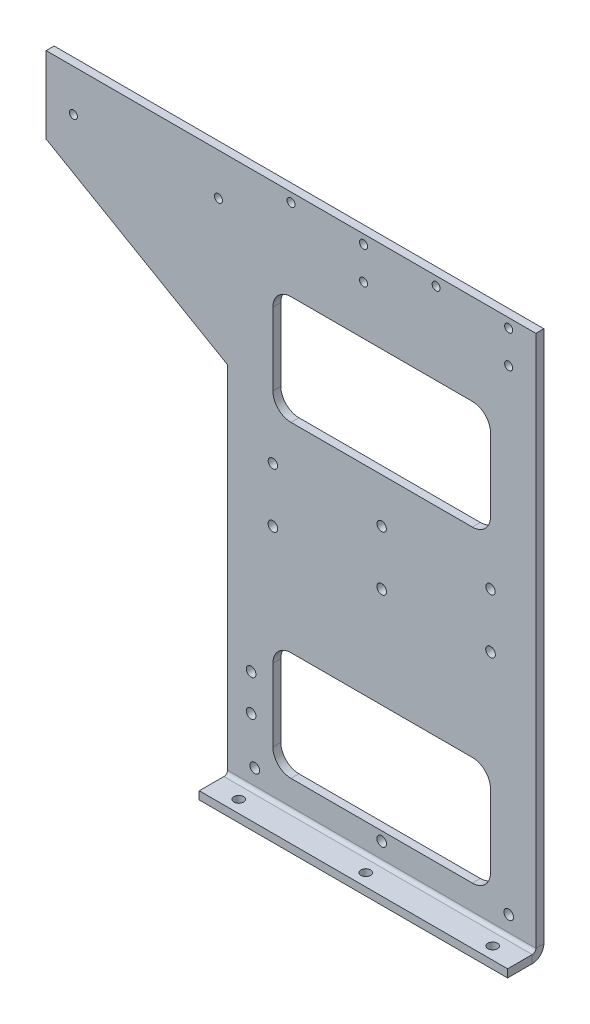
ISO-10303-21;
HEADER;
FILE_DESCRIPTION(('STEP AP214'),'2;1');
FILE_NAME('part.step','',(''),(''),'','','');
FILE_SCHEMA(('AUTOMOTIVE_DESIGN { 1 0 10303 214 1 1 1 1 }'));
ENDSEC;
DATA;
#1=APPLICATION_CONTEXT('core data for automotive mechanical design processes');
#2=APPLICATION_PROTOCOL_DEFINITION('international standard','automotive_design',2000,#1);
#3=PRODUCT_CONTEXT('',#1,'mechanical');
#4=PRODUCT('Part','Part','',(#3));
#5=PRODUCT_RELATED_PRODUCT_CATEGORY('part','',(#4));
#6=PRODUCT_DEFINITION_FORMATION('','',#4);
#7=PRODUCT_DEFINITION_CONTEXT('part definition',#1,'design');
#8=PRODUCT_DEFINITION('design','',#6,#7);
#9=PRODUCT_DEFINITION_SHAPE('','',#8);
#10=(LENGTH_UNIT() NAMED_UNIT(*) SI_UNIT(.MILLI.,.METRE.));
#11=(NAMED_UNIT(*) PLANE_ANGLE_UNIT() SI_UNIT($,.RADIAN.));
#12=(NAMED_UNIT(*) SI_UNIT($,.STERADIAN.) SOLID_ANGLE_UNIT());
#13=UNCERTAINTY_MEASURE_WITH_UNIT(LENGTH_MEASURE(1.E-05),#10,'distance_accuracy_value','');
#14=(GEOMETRIC_REPRESENTATION_CONTEXT(3) GLOBAL_UNCERTAINTY_ASSIGNED_CONTEXT((#13)) GLOBAL_UNIT_ASSIGNED_CONTEXT((#10,
#11,#12)) REPRESENTATION_CONTEXT('',''));
#15=CARTESIAN_POINT('',(0.,0.,0.));
#16=DIRECTION('',(0.,0.,1.));
#17=DIRECTION('',(1.,0.,0.));
#18=AXIS2_PLACEMENT_3D('',#15,#16,#17);
#19=CARTESIAN_POINT('',(0.,381.,0.));
#20=DIRECTION('',(0.,0.,1.));
#21=DIRECTION('',(1.,0.,0.));
#22=AXIS2_PLACEMENT_3D('',#19,#20,#21);
#23=PLANE('',#22);
#24=CARTESIAN_POINT('',(-199.39,50.8,0.));
#25=DIRECTION('',(0.,0.,-1.));
#26=DIRECTION('',(-1.,0.,0.));
#27=AXIS2_PLACEMENT_3D('',#24,#25,#26);
#28=CIRCLE('',#27,3.3782);
#29=CARTESIAN_POINT('',(-202.7682,50.8,0.));
#30=VERTEX_POINT('',#29);
#31=EDGE_CURVE('E1046',#30,#30,#28,.T.);
#32=ORIENTED_EDGE('',*,*,#31,.F.);
#33=EDGE_LOOP('',(#32));
#34=FACE_BOUND('',#33,.T.);
#35=CARTESIAN_POINT('',(-184.15,210.042499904,0.));
#36=DIRECTION('',(0.,0.,-1.));
#37=DIRECTION('',(-1.,0.,0.));
#38=AXIS2_PLACEMENT_3D('',#35,#36,#37);
#39=CIRCLE('',#38,3.26389999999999);
#40=CARTESIAN_POINT('',(-187.4139,210.042499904,0.));
#41=VERTEX_POINT('',#40);
#42=EDGE_CURVE('E213',#41,#41,#39,.T.);
#43=ORIENTED_EDGE('',*,*,#42,.F.);
#44=EDGE_LOOP('',(#43));
#45=FACE_BOUND('',#44,.T.);
#46=CARTESIAN_POINT('',(-184.15,171.942499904,0.));
#47=DIRECTION('',(0.,0.,1.));
#48=DIRECTION('',(1.,0.,0.));
#49=AXIS2_PLACEMENT_3D('',#46,#47,#48);
#50=CIRCLE('',#49,3.37819999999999);
#51=CARTESIAN_POINT('',(-180.7718,171.942499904,0.));
#52=VERTEX_POINT('',#51);
#53=EDGE_CURVE('E362',#52,#52,#50,.T.);
#54=ORIENTED_EDGE('',*,*,#53,.T.);
#55=EDGE_LOOP('',(#54));
#56=FACE_BOUND('',#55,.T.);
#57=CARTESIAN_POINT('',(-107.95,171.942499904,0.));
#58=DIRECTION('',(0.,0.,1.));
#59=DIRECTION('',(1.,0.,0.));
#60=AXIS2_PLACEMENT_3D('',#57,#58,#59);
#61=CIRCLE('',#60,3.37819999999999);
#62=CARTESIAN_POINT('',(-104.5718,171.942499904,0.));
#63=VERTEX_POINT('',#62);
#64=EDGE_CURVE('E487',#63,#63,#61,.T.);
#65=ORIENTED_EDGE('',*,*,#64,.T.);
#66=EDGE_LOOP('',(#65));
#67=FACE_BOUND('',#66,.T.);
#68=CARTESIAN_POINT('',(-31.75,171.942499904,0.));
#69=DIRECTION('',(0.,0.,1.));
#70=DIRECTION('',(1.,0.,0.));
#71=AXIS2_PLACEMENT_3D('',#68,#69,#70);
#72=CIRCLE('',#71,3.37819999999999);
#73=CARTESIAN_POINT('',(-28.3718,171.942499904,0.));
#74=VERTEX_POINT('',#73);
#75=EDGE_CURVE('E484',#74,#74,#72,.T.);
#76=ORIENTED_EDGE('',*,*,#75,.T.);
#77=EDGE_LOOP('',(#76));
#78=FACE_BOUND('',#77,.T.);
#79=CARTESIAN_POINT('',(-107.95,19.05,0.));
#80=DIRECTION('',(0.,0.,1.));
#81=DIRECTION('',(1.,0.,0.));
#82=AXIS2_PLACEMENT_3D('',#79,#80,#81);
#83=CIRCLE('',#82,3.37819999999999);
#84=CARTESIAN_POINT('',(-104.5718,19.05,0.));
#85=VERTEX_POINT('',#84);
#86=EDGE_CURVE('E481',#85,#85,#83,.T.);
#87=ORIENTED_EDGE('',*,*,#86,.T.);
#88=EDGE_LOOP('',(#87));
#89=FACE_BOUND('',#88,.T.);
#90=CARTESIAN_POINT('',(-196.85,19.05,0.));
#91=DIRECTION('',(0.,0.,1.));
#92=DIRECTION('',(1.,0.,0.));
#93=AXIS2_PLACEMENT_3D('',#90,#91,#92);
#94=CIRCLE('',#93,3.37819999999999);
#95=CARTESIAN_POINT('',(-193.4718,19.05,0.));
#96=VERTEX_POINT('',#95);
#97=EDGE_CURVE('E478',#96,#96,#94,.T.);
#98=ORIENTED_EDGE('',*,*,#97,.T.);
#99=EDGE_LOOP('',(#98));
#100=FACE_BOUND('',#99,.T.);
#101=CARTESIAN_POINT('',(-19.05,19.05,0.));
#102=DIRECTION('',(0.,0.,1.));
#103=DIRECTION('',(1.,0.,0.));
#104=AXIS2_PLACEMENT_3D('',#101,#102,#103);
#105=CIRCLE('',#104,3.37819999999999);
#106=CARTESIAN_POINT('',(-15.6718,19.05,0.));
#107=VERTEX_POINT('',#106);
#108=EDGE_CURVE('E475',#107,#107,#105,.T.);
#109=ORIENTED_EDGE('',*,*,#108,.T.);
#110=EDGE_LOOP('',(#109));
#111=FACE_BOUND('',#110,.T.);
#112=CARTESIAN_POINT('',(-171.45,374.65,0.));
#113=DIRECTION('',(0.,0.,1.));
#114=DIRECTION('',(1.,0.,0.));
#115=AXIS2_PLACEMENT_3D('',#112,#113,#114);
#116=CIRCLE('',#115,2.80670000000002);
#117=CARTESIAN_POINT('',(-168.6433,374.65,0.));
#118=VERTEX_POINT('',#117);
#119=EDGE_CURVE('E472',#118,#118,#116,.T.);
#120=ORIENTED_EDGE('',*,*,#119,.T.);
#121=EDGE_LOOP('',(#120));
#122=FACE_BOUND('',#121,.T.);
#123=CARTESIAN_POINT('',(-323.85,351.79,0.));
#124=DIRECTION('',(0.,0.,1.));
#125=DIRECTION('',(1.,0.,0.));
#126=AXIS2_PLACEMENT_3D('',#123,#124,#125);
#127=CIRCLE('',#126,2.8067);
#128=CARTESIAN_POINT('',(-321.0433,351.79,0.));
#129=VERTEX_POINT('',#128);
#130=EDGE_CURVE('E469',#129,#129,#127,.T.);
#131=ORIENTED_EDGE('',*,*,#130,.T.);
#132=EDGE_LOOP('',(#131));
#133=FACE_BOUND('',#132,.T.);
#134=CARTESIAN_POINT('',(-222.25,351.79,0.));
#135=DIRECTION('',(0.,0.,1.));
#136=DIRECTION('',(1.,0.,0.));
#137=AXIS2_PLACEMENT_3D('',#134,#135,#136);
#138=CIRCLE('',#137,2.80669999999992);
#139=CARTESIAN_POINT('',(-219.4433,351.79,0.));
#140=VERTEX_POINT('',#139);
#141=EDGE_CURVE('E466',#140,#140,#138,.T.);
#142=ORIENTED_EDGE('',*,*,#141,.T.);
#143=EDGE_LOOP('',(#142));
#144=FACE_BOUND('',#143,.T.);
#145=CARTESIAN_POINT('',(-120.65,351.79,0.));
#146=DIRECTION('',(0.,0.,1.));
#147=DIRECTION('',(1.,0.,0.));
#148=AXIS2_PLACEMENT_3D('',#145,#146,#147);
#149=CIRCLE('',#148,2.80669999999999);
#150=CARTESIAN_POINT('',(-117.8433,351.79,0.));
#151=VERTEX_POINT('',#150);
#152=EDGE_CURVE('E463',#151,#151,#149,.T.);
#153=ORIENTED_EDGE('',*,*,#152,.T.);
#154=EDGE_LOOP('',(#153));
#155=FACE_BOUND('',#154,.T.);
#156=CARTESIAN_POINT('',(-19.05,351.79,0.));
#157=DIRECTION('',(0.,0.,1.));
#158=DIRECTION('',(1.,0.,0.));
#159=AXIS2_PLACEMENT_3D('',#156,#157,#158);
#160=CIRCLE('',#159,2.80669999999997);
#161=CARTESIAN_POINT('',(-16.2433,351.79,0.));
#162=VERTEX_POINT('',#161);
#163=EDGE_CURVE('E460',#162,#162,#160,.T.);
#164=ORIENTED_EDGE('',*,*,#163,.T.);
#165=EDGE_LOOP('',(#164));
#166=FACE_BOUND('',#165,.T.);
#167=CARTESIAN_POINT('',(-69.85,374.65,0.));
#168=DIRECTION('',(0.,0.,1.));
#169=DIRECTION('',(1.,0.,0.));
#170=AXIS2_PLACEMENT_3D('',#167,#168,#169);
#171=CIRCLE('',#170,2.80669999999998);
#172=CARTESIAN_POINT('',(-67.0433,374.65,0.));
#173=VERTEX_POINT('',#172);
#174=EDGE_CURVE('E457',#173,#173,#171,.T.);
#175=ORIENTED_EDGE('',*,*,#174,.T.);
#176=EDGE_LOOP('',(#175));
#177=FACE_BOUND('',#176,.T.);
#178=CARTESIAN_POINT('',(-120.65,374.65,0.));
#179=DIRECTION('',(0.,0.,1.));
#180=DIRECTION('',(1.,0.,0.));
#181=AXIS2_PLACEMENT_3D('',#178,#179,#180);
#182=CIRCLE('',#181,2.80669999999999);
#183=CARTESIAN_POINT('',(-117.8433,374.65,0.));
#184=VERTEX_POINT('',#183);
#185=EDGE_CURVE('E454',#184,#184,#182,.T.);
#186=ORIENTED_EDGE('',*,*,#185,.T.);
#187=EDGE_LOOP('',(#186));
#188=FACE_BOUND('',#187,.T.);
#189=CARTESIAN_POINT('',(-19.05,374.65,0.));
#190=DIRECTION('',(0.,0.,1.));
#191=DIRECTION('',(1.,0.,0.));
#192=AXIS2_PLACEMENT_3D('',#189,#190,#191);
#193=CIRCLE('',#192,2.80669999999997);
#194=CARTESIAN_POINT('',(-16.2433,374.65,0.));
#195=VERTEX_POINT('',#194);
#196=EDGE_CURVE('E451',#195,#195,#193,.T.);
#197=ORIENTED_EDGE('',*,*,#196,.T.);
#198=EDGE_LOOP('',(#197));
#199=FACE_BOUND('',#198,.T.);
#200=DIRECTION('',(-1.,0.,0.));
#201=VECTOR('',#200,1.);
#202=CARTESIAN_POINT('',(-171.45,317.5,0.));
#203=LINE('',#202,#201);
#204=CARTESIAN_POINT('',(-44.45,317.5,0.));
#205=VERTEX_POINT('',#204);
#206=CARTESIAN_POINT('',(-171.45,317.5,0.));
#207=VERTEX_POINT('',#206);
#208=EDGE_CURVE('E427',#205,#207,#203,.T.);
#209=ORIENTED_EDGE('',*,*,#208,.T.);
#210=CARTESIAN_POINT('',(-171.45,304.8,0.));
#211=DIRECTION('',(0.,0.,1.));
#212=DIRECTION('',(1.,0.,0.));
#213=AXIS2_PLACEMENT_3D('',#210,#211,#212);
#214=CIRCLE('',#213,12.7);
#215=CARTESIAN_POINT('',(-184.15,304.8,0.));
#216=VERTEX_POINT('',#215);
#217=EDGE_CURVE('E430',#207,#216,#214,.T.);
#218=ORIENTED_EDGE('',*,*,#217,.T.);
#219=DIRECTION('',(0.,-1.,0.));
#220=VECTOR('',#219,1.);
#221=CARTESIAN_POINT('',(-184.15,304.8,0.));
#222=LINE('',#221,#220);
#223=CARTESIAN_POINT('',(-184.15,254.,0.));
#224=VERTEX_POINT('',#223);
#225=EDGE_CURVE('E433',#216,#224,#222,.T.);
#226=ORIENTED_EDGE('',*,*,#225,.T.);
#227=CARTESIAN_POINT('',(-171.45,254.,0.));
#228=DIRECTION('',(0.,0.,1.));
#229=DIRECTION('',(-1.,0.,0.));
#230=AXIS2_PLACEMENT_3D('',#227,#228,#229);
#231=CIRCLE('',#230,12.7);
#232=CARTESIAN_POINT('',(-171.45,241.3,0.));
#233=VERTEX_POINT('',#232);
#234=EDGE_CURVE('E436',#224,#233,#231,.T.);
#235=ORIENTED_EDGE('',*,*,#234,.T.);
#236=DIRECTION('',(1.,0.,0.));
#237=VECTOR('',#236,1.);
#238=CARTESIAN_POINT('',(-171.45,241.3,0.));
#239=LINE('',#238,#237);
#240=CARTESIAN_POINT('',(-44.45,241.3,0.));
#241=VERTEX_POINT('',#240);
#242=EDGE_CURVE('E439',#233,#241,#239,.T.);
#243=ORIENTED_EDGE('',*,*,#242,.T.);
#244=CARTESIAN_POINT('',(-44.45,254.,0.));
#245=DIRECTION('',(0.,0.,1.));
#246=DIRECTION('',(1.,0.,0.));
#247=AXIS2_PLACEMENT_3D('',#244,#245,#246);
#248=CIRCLE('',#247,12.7);
#249=CARTESIAN_POINT('',(-31.75,254.,0.));
#250=VERTEX_POINT('',#249);
#251=EDGE_CURVE('E442',#241,#250,#248,.T.);
#252=ORIENTED_EDGE('',*,*,#251,.T.);
#253=DIRECTION('',(0.,1.,0.));
#254=VECTOR('',#253,1.);
#255=CARTESIAN_POINT('',(-31.75,304.8,0.));
#256=LINE('',#255,#254);
#257=CARTESIAN_POINT('',(-31.75,304.8,0.));
#258=VERTEX_POINT('',#257);
#259=EDGE_CURVE('E445',#250,#258,#256,.T.);
#260=ORIENTED_EDGE('',*,*,#259,.T.);
#261=CARTESIAN_POINT('',(-44.45,304.8,0.));
#262=DIRECTION('',(0.,0.,1.));
#263=DIRECTION('',(1.,0.,0.));
#264=AXIS2_PLACEMENT_3D('',#261,#262,#263);
#265=CIRCLE('',#264,12.7);
#266=EDGE_CURVE('E448',#258,#205,#265,.T.);
#267=ORIENTED_EDGE('',*,*,#266,.T.);
#268=EDGE_LOOP('',(#209,#218,#226,#235,#243,#252,#260,#267));
#269=FACE_BOUND('',#268,.T.);
#270=DIRECTION('',(-1.,0.,0.));
#271=VECTOR('',#270,1.);
#272=CARTESIAN_POINT('',(-171.45,101.6,0.));
#273=LINE('',#272,#271);
#274=CARTESIAN_POINT('',(-44.45,101.6,0.));
#275=VERTEX_POINT('',#274);
#276=CARTESIAN_POINT('',(-171.45,101.6,0.));
#277=VERTEX_POINT('',#276);
#278=EDGE_CURVE('E403',#275,#277,#273,.T.);
#279=ORIENTED_EDGE('',*,*,#278,.T.);
#280=CARTESIAN_POINT('',(-171.45,88.9,0.));
#281=DIRECTION('',(0.,0.,1.));
#282=DIRECTION('',(1.,0.,0.));
#283=AXIS2_PLACEMENT_3D('',#280,#281,#282);
#284=CIRCLE('',#283,12.7);
#285=CARTESIAN_POINT('',(-184.15,88.9,0.));
#286=VERTEX_POINT('',#285);
#287=EDGE_CURVE('E406',#277,#286,#284,.T.);
#288=ORIENTED_EDGE('',*,*,#287,.T.);
#289=DIRECTION('',(0.,-1.,0.));
#290=VECTOR('',#289,1.);
#291=CARTESIAN_POINT('',(-184.15,88.9,0.));
#292=LINE('',#291,#290);
#293=CARTESIAN_POINT('',(-184.15,38.1,0.));
#294=VERTEX_POINT('',#293);
#295=EDGE_CURVE('E409',#286,#294,#292,.T.);
#296=ORIENTED_EDGE('',*,*,#295,.T.);
#297=CARTESIAN_POINT('',(-171.45,38.1,0.));
#298=DIRECTION('',(0.,0.,1.));
#299=DIRECTION('',(1.,0.,0.));
#300=AXIS2_PLACEMENT_3D('',#297,#298,#299);
#301=CIRCLE('',#300,12.7);
#302=CARTESIAN_POINT('',(-171.45,25.4,0.));
#303=VERTEX_POINT('',#302);
#304=EDGE_CURVE('E412',#294,#303,#301,.T.);
#305=ORIENTED_EDGE('',*,*,#304,.T.);
#306=DIRECTION('',(1.,0.,0.));
#307=VECTOR('',#306,1.);
#308=CARTESIAN_POINT('',(-171.45,25.4,0.));
#309=LINE('',#308,#307);
#310=CARTESIAN_POINT('',(-44.45,25.4,0.));
#311=VERTEX_POINT('',#310);
#312=EDGE_CURVE('E415',#303,#311,#309,.T.);
#313=ORIENTED_EDGE('',*,*,#312,.T.);
#314=CARTESIAN_POINT('',(-44.45,38.1,0.));
#315=DIRECTION('',(0.,0.,1.));
#316=DIRECTION('',(-1.,0.,0.));
#317=AXIS2_PLACEMENT_3D('',#314,#315,#316);
#318=CIRCLE('',#317,12.7);
#319=CARTESIAN_POINT('',(-31.75,38.1,0.));
#320=VERTEX_POINT('',#319);
#321=EDGE_CURVE('E418',#311,#320,#318,.T.);
#322=ORIENTED_EDGE('',*,*,#321,.T.);
#323=DIRECTION('',(0.,1.,0.));
#324=VECTOR('',#323,1.);
#325=CARTESIAN_POINT('',(-31.75,88.9,0.));
#326=LINE('',#325,#324);
#327=CARTESIAN_POINT('',(-31.75,88.9,0.));
#328=VERTEX_POINT('',#327);
#329=EDGE_CURVE('E421',#320,#328,#326,.T.);
#330=ORIENTED_EDGE('',*,*,#329,.T.);
#331=CARTESIAN_POINT('',(-44.45,88.9,0.));
#332=DIRECTION('',(0.,0.,1.));
#333=DIRECTION('',(1.,0.,0.));
#334=AXIS2_PLACEMENT_3D('',#331,#332,#333);
#335=CIRCLE('',#334,12.7);
#336=EDGE_CURVE('E424',#328,#275,#335,.T.);
#337=ORIENTED_EDGE('',*,*,#336,.T.);
#338=EDGE_LOOP('',(#279,#288,#296,#305,#313,#322,#330,#337));
#339=FACE_BOUND('',#338,.T.);
#340=CARTESIAN_POINT('',(-31.75,210.042499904,0.));
#341=DIRECTION('',(0.,0.,-1.));
#342=DIRECTION('',(-1.,0.,0.));
#343=AXIS2_PLACEMENT_3D('',#340,#341,#342);
#344=CIRCLE('',#343,3.2639);
#345=CARTESIAN_POINT('',(-35.0139,210.042499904,0.));
#346=VERTEX_POINT('',#345);
#347=EDGE_CURVE('E400',#346,#346,#344,.T.);
#348=ORIENTED_EDGE('',*,*,#347,.F.);
#349=EDGE_LOOP('',(#348));
#350=FACE_BOUND('',#349,.T.);
#351=CARTESIAN_POINT('',(-107.95,210.042499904,0.));
#352=DIRECTION('',(0.,0.,-1.));
#353=DIRECTION('',(-1.,0.,0.));
#354=AXIS2_PLACEMENT_3D('',#351,#352,#353);
#355=CIRCLE('',#354,3.2639);
#356=CARTESIAN_POINT('',(-111.2139,210.042499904,0.));
#357=VERTEX_POINT('',#356);
#358=EDGE_CURVE('E186',#357,#357,#355,.T.);
#359=ORIENTED_EDGE('',*,*,#358,.F.);
#360=EDGE_LOOP('',(#359));
#361=FACE_BOUND('',#360,.T.);
#362=DIRECTION('',(1.,0.,0.));
#363=VECTOR('',#362,1.);
#364=CARTESIAN_POINT('',(0.,8.12800000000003,0.));
#365=LINE('',#364,#363);
#366=CARTESIAN_POINT('',(0.,8.12800000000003,0.));
#367=VERTEX_POINT('',#366);
#368=CARTESIAN_POINT('',(-215.9,8.12800000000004,0.));
#369=VERTEX_POINT('',#368);
#370=EDGE_CURVE('E359',#367,#369,#365,.F.);
#371=ORIENTED_EDGE('',*,*,#370,.T.);
#372=DIRECTION('',(0.,-1.,0.));
#373=VECTOR('',#372,1.);
#374=CARTESIAN_POINT('',(-215.9,0.,0.));
#375=LINE('',#374,#373);
#376=CARTESIAN_POINT('',(-215.9,254.,0.));
#377=VERTEX_POINT('',#376);
#378=EDGE_CURVE('E249',#377,#369,#375,.T.);
#379=ORIENTED_EDGE('',*,*,#378,.F.);
#380=DIRECTION('',(0.86602540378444,-0.499999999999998,0.));
#381=VECTOR('',#380,1.);
#382=CARTESIAN_POINT('',(-215.9,254.,0.));
#383=LINE('',#382,#381);
#384=CARTESIAN_POINT('',(-342.9,327.323484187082,0.));
#385=VERTEX_POINT('',#384);
#386=EDGE_CURVE('E160',#385,#377,#383,.T.);
#387=ORIENTED_EDGE('',*,*,#386,.F.);
#388=DIRECTION('',(0.,-1.,0.));
#389=VECTOR('',#388,1.);
#390=CARTESIAN_POINT('',(-342.9,327.323484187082,0.));
#391=LINE('',#390,#389);
#392=CARTESIAN_POINT('',(-342.9,381.,0.));
#393=VERTEX_POINT('',#392);
#394=EDGE_CURVE('E247',#393,#385,#391,.T.);
#395=ORIENTED_EDGE('',*,*,#394,.F.);
#396=DIRECTION('',(-1.,0.,0.));
#397=VECTOR('',#396,1.);
#398=CARTESIAN_POINT('',(0.,381.,0.));
#399=LINE('',#398,#397);
#400=CARTESIAN_POINT('',(0.,381.,0.));
#401=VERTEX_POINT('',#400);
#402=EDGE_CURVE('E252',#401,#393,#399,.T.);
#403=ORIENTED_EDGE('',*,*,#402,.F.);
#404=DIRECTION('',(0.,1.,0.));
#405=VECTOR('',#404,1.);
#406=CARTESIAN_POINT('',(0.,0.,0.));
#407=LINE('',#406,#405);
#408=EDGE_CURVE('E85',#367,#401,#407,.T.);
#409=ORIENTED_EDGE('',*,*,#408,.F.);
#410=EDGE_LOOP('',(#371,#379,#387,#395,#403,#409));
#411=FACE_BOUND('',#410,.T.);
#412=CARTESIAN_POINT('',(-199.39,76.2,0.));
#413=DIRECTION('',(0.,0.,-1.));
#414=DIRECTION('',(-1.,0.,0.));
#415=AXIS2_PLACEMENT_3D('',#412,#413,#414);
#416=CIRCLE('',#415,3.3782);
#417=CARTESIAN_POINT('',(-202.7682,76.2,0.));
#418=VERTEX_POINT('',#417);
#419=EDGE_CURVE('E1042',#418,#418,#416,.T.);
#420=ORIENTED_EDGE('',*,*,#419,.F.);
#421=EDGE_LOOP('',(#420));
#422=FACE_BOUND('',#421,.T.);
#423=ADVANCED_FACE('F61',(#34,#45,#56,#67,#78,#89,#100,#111,#122,#133,#144,#155,#166,#177,#188,
#199,#269,#339,#350,#361,#411,#422),#23,.F.);
#424=CARTESIAN_POINT('',(0.,0.,0.));
#425=DIRECTION('',(1.,0.,0.));
#426=DIRECTION('',(0.,1.,0.));
#427=AXIS2_PLACEMENT_3D('',#424,#425,#426);
#428=PLANE('',#427);
#429=DIRECTION('',(0.,1.,0.));
#430=VECTOR('',#429,1.);
#431=CARTESIAN_POINT('',(0.,381.,5.588));
#432=LINE('',#431,#430);
#433=CARTESIAN_POINT('',(0.,8.12800000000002,5.588));
#434=VERTEX_POINT('',#433);
#435=CARTESIAN_POINT('',(0.,381.,5.588));
#436=VERTEX_POINT('',#435);
#437=EDGE_CURVE('E177',#434,#436,#432,.T.);
#438=ORIENTED_EDGE('',*,*,#437,.F.);
#439=DIRECTION('',(0.,0.,-1.));
#440=VECTOR('',#439,1.);
#441=CARTESIAN_POINT('',(0.,8.12800000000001,5.588));
#442=LINE('',#441,#440);
#443=EDGE_CURVE('E365',#434,#367,#442,.T.);
#444=ORIENTED_EDGE('',*,*,#443,.T.);
#445=ORIENTED_EDGE('',*,*,#408,.T.);
#446=DIRECTION('',(0.,0.,-1.));
#447=VECTOR('',#446,1.);
#448=CARTESIAN_POINT('',(0.,381.,0.));
#449=LINE('',#448,#447);
#450=EDGE_CURVE('E235',#436,#401,#449,.T.);
#451=ORIENTED_EDGE('',*,*,#450,.F.);
#452=EDGE_LOOP('',(#438,#444,#445,#451));
#453=FACE_BOUND('',#452,.T.);
#454=ADVANCED_FACE('F366',(#453),#428,.T.);
#455=CARTESIAN_POINT('',(0.,381.,5.588));
#456=DIRECTION('',(0.,0.,1.));
#457=DIRECTION('',(1.,0.,0.));
#458=AXIS2_PLACEMENT_3D('',#455,#456,#457);
#459=PLANE('',#458);
#460=CARTESIAN_POINT('',(-199.39,76.2,5.588));
#461=DIRECTION('',(0.,0.,1.));
#462=DIRECTION('',(1.,0.,0.));
#463=AXIS2_PLACEMENT_3D('',#460,#461,#462);
#464=CIRCLE('',#463,3.3782);
#465=CARTESIAN_POINT('',(-196.0118,76.2,5.588));
#466=VERTEX_POINT('',#465);
#467=EDGE_CURVE('E1045',#466,#466,#464,.T.);
#468=ORIENTED_EDGE('',*,*,#467,.F.);
#469=EDGE_LOOP('',(#468));
#470=FACE_BOUND('',#469,.T.);
#471=CARTESIAN_POINT('',(-199.39,50.8,5.588));
#472=DIRECTION('',(0.,0.,1.));
#473=DIRECTION('',(1.,0.,0.));
#474=AXIS2_PLACEMENT_3D('',#471,#472,#473);
#475=CIRCLE('',#474,3.3782);
#476=CARTESIAN_POINT('',(-196.0118,50.8,5.588));
#477=VERTEX_POINT('',#476);
#478=EDGE_CURVE('E1049',#477,#477,#475,.T.);
#479=ORIENTED_EDGE('',*,*,#478,.F.);
#480=EDGE_LOOP('',(#479));
#481=FACE_BOUND('',#480,.T.);
#482=CARTESIAN_POINT('',(-107.95,210.042499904,5.588));
#483=DIRECTION('',(0.,0.,-1.));
#484=DIRECTION('',(-1.,0.,0.));
#485=AXIS2_PLACEMENT_3D('',#482,#483,#484);
#486=CIRCLE('',#485,3.2639);
#487=CARTESIAN_POINT('',(-111.2139,210.042499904,5.588));
#488=VERTEX_POINT('',#487);
#489=EDGE_CURVE('E259',#488,#488,#486,.T.);
#490=ORIENTED_EDGE('',*,*,#489,.T.);
#491=EDGE_LOOP('',(#490));
#492=FACE_BOUND('',#491,.T.);
#493=CARTESIAN_POINT('',(-31.75,210.042499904,5.588));
#494=DIRECTION('',(0.,0.,-1.));
#495=DIRECTION('',(-1.,0.,0.));
#496=AXIS2_PLACEMENT_3D('',#493,#494,#495);
#497=CIRCLE('',#496,3.2639);
#498=CARTESIAN_POINT('',(-35.0139,210.042499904,5.588));
#499=VERTEX_POINT('',#498);
#500=EDGE_CURVE('E262',#499,#499,#497,.T.);
#501=ORIENTED_EDGE('',*,*,#500,.T.);
#502=EDGE_LOOP('',(#501));
#503=FACE_BOUND('',#502,.T.);
#504=DIRECTION('',(1.,0.,0.));
#505=VECTOR('',#504,1.);
#506=CARTESIAN_POINT('',(0.,101.6,5.588));
#507=LINE('',#506,#505);
#508=CARTESIAN_POINT('',(-44.45,101.6,5.588));
#509=VERTEX_POINT('',#508);
#510=CARTESIAN_POINT('',(-171.45,101.6,5.588));
#511=VERTEX_POINT('',#510);
#512=EDGE_CURVE('E265',#509,#511,#507,.F.);
#513=ORIENTED_EDGE('',*,*,#512,.F.);
#514=CARTESIAN_POINT('',(-44.45,88.9,5.588));
#515=DIRECTION('',(0.,0.,1.));
#516=DIRECTION('',(1.,0.,0.));
#517=AXIS2_PLACEMENT_3D('',#514,#515,#516);
#518=CIRCLE('',#517,12.7);
#519=CARTESIAN_POINT('',(-31.75,88.9,5.588));
#520=VERTEX_POINT('',#519);
#521=EDGE_CURVE('E269',#520,#509,#518,.T.);
#522=ORIENTED_EDGE('',*,*,#521,.F.);
#523=DIRECTION('',(0.,1.,0.));
#524=VECTOR('',#523,1.);
#525=CARTESIAN_POINT('',(-31.75,381.,5.588));
#526=LINE('',#525,#524);
#527=CARTESIAN_POINT('',(-31.75,38.1,5.588));
#528=VERTEX_POINT('',#527);
#529=EDGE_CURVE('E273',#528,#520,#526,.T.);
#530=ORIENTED_EDGE('',*,*,#529,.F.);
#531=CARTESIAN_POINT('',(-44.45,38.1,5.588));
#532=DIRECTION('',(0.,0.,1.));
#533=DIRECTION('',(1.,0.,0.));
#534=AXIS2_PLACEMENT_3D('',#531,#532,#533);
#535=CIRCLE('',#534,12.7);
#536=CARTESIAN_POINT('',(-44.45,25.4,5.588));
#537=VERTEX_POINT('',#536);
#538=EDGE_CURVE('E276',#537,#528,#535,.T.);
#539=ORIENTED_EDGE('',*,*,#538,.F.);
#540=DIRECTION('',(1.,0.,0.));
#541=VECTOR('',#540,1.);
#542=CARTESIAN_POINT('',(0.,25.4,5.588));
#543=LINE('',#542,#541);
#544=CARTESIAN_POINT('',(-171.45,25.4,5.588));
#545=VERTEX_POINT('',#544);
#546=EDGE_CURVE('E279',#545,#537,#543,.T.);
#547=ORIENTED_EDGE('',*,*,#546,.F.);
#548=CARTESIAN_POINT('',(-171.45,38.1,5.588));
#549=DIRECTION('',(0.,0.,1.));
#550=DIRECTION('',(1.,0.,0.));
#551=AXIS2_PLACEMENT_3D('',#548,#549,#550);
#552=CIRCLE('',#551,12.7);
#553=CARTESIAN_POINT('',(-184.15,38.1,5.588));
#554=VERTEX_POINT('',#553);
#555=EDGE_CURVE('E282',#554,#545,#552,.T.);
#556=ORIENTED_EDGE('',*,*,#555,.F.);
#557=DIRECTION('',(0.,1.,0.));
#558=VECTOR('',#557,1.);
#559=CARTESIAN_POINT('',(-184.15,381.,5.588));
#560=LINE('',#559,#558);
#561=CARTESIAN_POINT('',(-184.15,88.9,5.588));
#562=VERTEX_POINT('',#561);
#563=EDGE_CURVE('E285',#562,#554,#560,.F.);
#564=ORIENTED_EDGE('',*,*,#563,.F.);
#565=CARTESIAN_POINT('',(-171.45,88.9,5.588));
#566=DIRECTION('',(0.,0.,1.));
#567=DIRECTION('',(1.,0.,0.));
#568=AXIS2_PLACEMENT_3D('',#565,#566,#567);
#569=CIRCLE('',#568,12.7);
#570=EDGE_CURVE('E268',#511,#562,#569,.T.);
#571=ORIENTED_EDGE('',*,*,#570,.F.);
#572=EDGE_LOOP('',(#513,#522,#530,#539,#547,#556,#564,#571));
#573=FACE_BOUND('',#572,.T.);
#574=DIRECTION('',(1.,0.,0.));
#575=VECTOR('',#574,1.);
#576=CARTESIAN_POINT('',(0.,317.5,5.588));
#577=LINE('',#576,#575);
#578=CARTESIAN_POINT('',(-44.45,317.5,5.588));
#579=VERTEX_POINT('',#578);
#580=CARTESIAN_POINT('',(-171.45,317.5,5.588));
#581=VERTEX_POINT('',#580);
#582=EDGE_CURVE('E272',#579,#581,#577,.F.);
#583=ORIENTED_EDGE('',*,*,#582,.F.);
#584=CARTESIAN_POINT('',(-44.45,304.8,5.588));
#585=DIRECTION('',(0.,0.,1.));
#586=DIRECTION('',(1.,0.,0.));
#587=AXIS2_PLACEMENT_3D('',#584,#585,#586);
#588=CIRCLE('',#587,12.7);
#589=CARTESIAN_POINT('',(-31.75,304.8,5.588));
#590=VERTEX_POINT('',#589);
#591=EDGE_CURVE('E293',#590,#579,#588,.T.);
#592=ORIENTED_EDGE('',*,*,#591,.F.);
#593=DIRECTION('',(0.,1.,0.));
#594=VECTOR('',#593,1.);
#595=CARTESIAN_POINT('',(-31.75,381.,5.588));
#596=LINE('',#595,#594);
#597=CARTESIAN_POINT('',(-31.75,254.,5.588));
#598=VERTEX_POINT('',#597);
#599=EDGE_CURVE('E297',#598,#590,#596,.T.);
#600=ORIENTED_EDGE('',*,*,#599,.F.);
#601=CARTESIAN_POINT('',(-44.45,254.,5.588));
#602=DIRECTION('',(0.,0.,1.));
#603=DIRECTION('',(1.,0.,0.));
#604=AXIS2_PLACEMENT_3D('',#601,#602,#603);
#605=CIRCLE('',#604,12.7);
#606=CARTESIAN_POINT('',(-44.45,241.3,5.588));
#607=VERTEX_POINT('',#606);
#608=EDGE_CURVE('E300',#607,#598,#605,.T.);
#609=ORIENTED_EDGE('',*,*,#608,.F.);
#610=DIRECTION('',(1.,0.,0.));
#611=VECTOR('',#610,1.);
#612=CARTESIAN_POINT('',(0.,241.3,5.588));
#613=LINE('',#612,#611);
#614=CARTESIAN_POINT('',(-171.45,241.3,5.588));
#615=VERTEX_POINT('',#614);
#616=EDGE_CURVE('E303',#615,#607,#613,.T.);
#617=ORIENTED_EDGE('',*,*,#616,.F.);
#618=CARTESIAN_POINT('',(-171.45,254.,5.588));
#619=DIRECTION('',(0.,0.,1.));
#620=DIRECTION('',(1.,0.,0.));
#621=AXIS2_PLACEMENT_3D('',#618,#619,#620);
#622=CIRCLE('',#621,12.7);
#623=CARTESIAN_POINT('',(-184.15,254.,5.588));
#624=VERTEX_POINT('',#623);
#625=EDGE_CURVE('E306',#624,#615,#622,.T.);
#626=ORIENTED_EDGE('',*,*,#625,.F.);
#627=DIRECTION('',(0.,1.,0.));
#628=VECTOR('',#627,1.);
#629=CARTESIAN_POINT('',(-184.15,381.,5.588));
#630=LINE('',#629,#628);
#631=CARTESIAN_POINT('',(-184.15,304.8,5.588));
#632=VERTEX_POINT('',#631);
#633=EDGE_CURVE('E309',#632,#624,#630,.F.);
#634=ORIENTED_EDGE('',*,*,#633,.F.);
#635=CARTESIAN_POINT('',(-171.45,304.8,5.588));
#636=DIRECTION('',(0.,0.,1.));
#637=DIRECTION('',(1.,0.,0.));
#638=AXIS2_PLACEMENT_3D('',#635,#636,#637);
#639=CIRCLE('',#638,12.7);
#640=EDGE_CURVE('E292',#581,#632,#639,.T.);
#641=ORIENTED_EDGE('',*,*,#640,.F.);
#642=EDGE_LOOP('',(#583,#592,#600,#609,#617,#626,#634,#641));
#643=FACE_BOUND('',#642,.T.);
#644=CARTESIAN_POINT('',(-19.05,374.65,5.588));
#645=DIRECTION('',(0.,0.,1.));
#646=DIRECTION('',(1.,0.,0.));
#647=AXIS2_PLACEMENT_3D('',#644,#645,#646);
#648=CIRCLE('',#647,2.80669999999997);
#649=CARTESIAN_POINT('',(-16.2433,374.65,5.588));
#650=VERTEX_POINT('',#649);
#651=EDGE_CURVE('E296',#650,#650,#648,.T.);
#652=ORIENTED_EDGE('',*,*,#651,.F.);
#653=EDGE_LOOP('',(#652));
#654=FACE_BOUND('',#653,.T.);
#655=CARTESIAN_POINT('',(-120.65,374.65,5.588));
#656=DIRECTION('',(0.,0.,1.));
#657=DIRECTION('',(1.,0.,0.));
#658=AXIS2_PLACEMENT_3D('',#655,#656,#657);
#659=CIRCLE('',#658,2.80669999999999);
#660=CARTESIAN_POINT('',(-117.8433,374.65,5.588));
#661=VERTEX_POINT('',#660);
#662=EDGE_CURVE('E316',#661,#661,#659,.T.);
#663=ORIENTED_EDGE('',*,*,#662,.F.);
#664=EDGE_LOOP('',(#663));
#665=FACE_BOUND('',#664,.T.);
#666=CARTESIAN_POINT('',(-69.85,374.65,5.588));
#667=DIRECTION('',(0.,0.,1.));
#668=DIRECTION('',(1.,0.,0.));
#669=AXIS2_PLACEMENT_3D('',#666,#667,#668);
#670=CIRCLE('',#669,2.80669999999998);
#671=CARTESIAN_POINT('',(-67.0433,374.65,5.588));
#672=VERTEX_POINT('',#671);
#673=EDGE_CURVE('E319',#672,#672,#670,.T.);
#674=ORIENTED_EDGE('',*,*,#673,.F.);
#675=EDGE_LOOP('',(#674));
#676=FACE_BOUND('',#675,.T.);
#677=CARTESIAN_POINT('',(-19.05,351.79,5.588));
#678=DIRECTION('',(0.,0.,1.));
#679=DIRECTION('',(1.,0.,0.));
#680=AXIS2_PLACEMENT_3D('',#677,#678,#679);
#681=CIRCLE('',#680,2.80669999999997);
#682=CARTESIAN_POINT('',(-16.2433,351.79,5.588));
#683=VERTEX_POINT('',#682);
#684=EDGE_CURVE('E322',#683,#683,#681,.T.);
#685=ORIENTED_EDGE('',*,*,#684,.F.);
#686=EDGE_LOOP('',(#685));
#687=FACE_BOUND('',#686,.T.);
#688=CARTESIAN_POINT('',(-120.65,351.79,5.588));
#689=DIRECTION('',(0.,0.,1.));
#690=DIRECTION('',(1.,0.,0.));
#691=AXIS2_PLACEMENT_3D('',#688,#689,#690);
#692=CIRCLE('',#691,2.80669999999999);
#693=CARTESIAN_POINT('',(-117.8433,351.79,5.588));
#694=VERTEX_POINT('',#693);
#695=EDGE_CURVE('E325',#694,#694,#692,.T.);
#696=ORIENTED_EDGE('',*,*,#695,.F.);
#697=EDGE_LOOP('',(#696));
#698=FACE_BOUND('',#697,.T.);
#699=CARTESIAN_POINT('',(-222.25,351.79,5.588));
#700=DIRECTION('',(0.,0.,1.));
#701=DIRECTION('',(1.,0.,0.));
#702=AXIS2_PLACEMENT_3D('',#699,#700,#701);
#703=CIRCLE('',#702,2.80669999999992);
#704=CARTESIAN_POINT('',(-219.4433,351.79,5.588));
#705=VERTEX_POINT('',#704);
#706=EDGE_CURVE('E328',#705,#705,#703,.T.);
#707=ORIENTED_EDGE('',*,*,#706,.F.);
#708=EDGE_LOOP('',(#707));
#709=FACE_BOUND('',#708,.T.);
#710=CARTESIAN_POINT('',(-323.85,351.79,5.588));
#711=DIRECTION('',(0.,0.,1.));
#712=DIRECTION('',(1.,0.,0.));
#713=AXIS2_PLACEMENT_3D('',#710,#711,#712);
#714=CIRCLE('',#713,2.8067);
#715=CARTESIAN_POINT('',(-321.0433,351.79,5.588));
#716=VERTEX_POINT('',#715);
#717=EDGE_CURVE('E331',#716,#716,#714,.T.);
#718=ORIENTED_EDGE('',*,*,#717,.F.);
#719=EDGE_LOOP('',(#718));
#720=FACE_BOUND('',#719,.T.);
#721=CARTESIAN_POINT('',(-171.45,374.65,5.588));
#722=DIRECTION('',(0.,0.,1.));
#723=DIRECTION('',(1.,0.,0.));
#724=AXIS2_PLACEMENT_3D('',#721,#722,#723);
#725=CIRCLE('',#724,2.80670000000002);
#726=CARTESIAN_POINT('',(-168.6433,374.65,5.588));
#727=VERTEX_POINT('',#726);
#728=EDGE_CURVE('E334',#727,#727,#725,.T.);
#729=ORIENTED_EDGE('',*,*,#728,.F.);
#730=EDGE_LOOP('',(#729));
#731=FACE_BOUND('',#730,.T.);
#732=CARTESIAN_POINT('',(-19.05,19.05,5.588));
#733=DIRECTION('',(0.,0.,1.));
#734=DIRECTION('',(1.,0.,0.));
#735=AXIS2_PLACEMENT_3D('',#732,#733,#734);
#736=CIRCLE('',#735,3.37819999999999);
#737=CARTESIAN_POINT('',(-15.6718,19.05,5.588));
#738=VERTEX_POINT('',#737);
#739=EDGE_CURVE('E337',#738,#738,#736,.T.);
#740=ORIENTED_EDGE('',*,*,#739,.F.);
#741=EDGE_LOOP('',(#740));
#742=FACE_BOUND('',#741,.T.);
#743=CARTESIAN_POINT('',(-196.85,19.05,5.588));
#744=DIRECTION('',(0.,0.,1.));
#745=DIRECTION('',(1.,0.,0.));
#746=AXIS2_PLACEMENT_3D('',#743,#744,#745);
#747=CIRCLE('',#746,3.37819999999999);
#748=CARTESIAN_POINT('',(-193.4718,19.05,5.588));
#749=VERTEX_POINT('',#748);
#750=EDGE_CURVE('E340',#749,#749,#747,.T.);
#751=ORIENTED_EDGE('',*,*,#750,.F.);
#752=EDGE_LOOP('',(#751));
#753=FACE_BOUND('',#752,.T.);
#754=CARTESIAN_POINT('',(-107.95,19.05,5.588));
#755=DIRECTION('',(0.,0.,1.));
#756=DIRECTION('',(1.,0.,0.));
#757=AXIS2_PLACEMENT_3D('',#754,#755,#756);
#758=CIRCLE('',#757,3.37819999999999);
#759=CARTESIAN_POINT('',(-104.5718,19.05,5.588));
#760=VERTEX_POINT('',#759);
#761=EDGE_CURVE('E343',#760,#760,#758,.T.);
#762=ORIENTED_EDGE('',*,*,#761,.F.);
#763=EDGE_LOOP('',(#762));
#764=FACE_BOUND('',#763,.T.);
#765=CARTESIAN_POINT('',(-31.75,171.942499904,5.588));
#766=DIRECTION('',(0.,0.,1.));
#767=DIRECTION('',(1.,0.,0.));
#768=AXIS2_PLACEMENT_3D('',#765,#766,#767);
#769=CIRCLE('',#768,3.37819999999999);
#770=CARTESIAN_POINT('',(-28.3718,171.942499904,5.588));
#771=VERTEX_POINT('',#770);
#772=EDGE_CURVE('E346',#771,#771,#769,.T.);
#773=ORIENTED_EDGE('',*,*,#772,.F.);
#774=EDGE_LOOP('',(#773));
#775=FACE_BOUND('',#774,.T.);
#776=CARTESIAN_POINT('',(-107.95,171.942499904,5.588));
#777=DIRECTION('',(0.,0.,1.));
#778=DIRECTION('',(1.,0.,0.));
#779=AXIS2_PLACEMENT_3D('',#776,#777,#778);
#780=CIRCLE('',#779,3.37819999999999);
#781=CARTESIAN_POINT('',(-104.5718,171.942499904,5.588));
#782=VERTEX_POINT('',#781);
#783=EDGE_CURVE('E349',#782,#782,#780,.T.);
#784=ORIENTED_EDGE('',*,*,#783,.F.);
#785=EDGE_LOOP('',(#784));
#786=FACE_BOUND('',#785,.T.);
#787=CARTESIAN_POINT('',(-184.15,171.942499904,5.588));
#788=DIRECTION('',(0.,0.,1.));
#789=DIRECTION('',(1.,0.,0.));
#790=AXIS2_PLACEMENT_3D('',#787,#788,#789);
#791=CIRCLE('',#790,3.37819999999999);
#792=CARTESIAN_POINT('',(-180.7718,171.942499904,5.588));
#793=VERTEX_POINT('',#792);
#794=EDGE_CURVE('E179',#793,#793,#791,.T.);
#795=ORIENTED_EDGE('',*,*,#794,.F.);
#796=EDGE_LOOP('',(#795));
#797=FACE_BOUND('',#796,.T.);
#798=CARTESIAN_POINT('',(-184.15,210.042499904,5.588));
#799=DIRECTION('',(0.,0.,-1.));
#800=DIRECTION('',(-1.,0.,0.));
#801=AXIS2_PLACEMENT_3D('',#798,#799,#800);
#802=CIRCLE('',#801,3.26389999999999);
#803=CARTESIAN_POINT('',(-187.4139,210.042499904,5.588));
#804=VERTEX_POINT('',#803);
#805=EDGE_CURVE('E183',#804,#804,#802,.T.);
#806=ORIENTED_EDGE('',*,*,#805,.T.);
#807=EDGE_LOOP('',(#806));
#808=FACE_BOUND('',#807,.T.);
#809=DIRECTION('',(0.,1.,0.));
#810=VECTOR('',#809,1.);
#811=CARTESIAN_POINT('',(-215.9,381.,5.588));
#812=LINE('',#811,#810);
#813=CARTESIAN_POINT('',(-215.9,254.,5.588));
#814=VERTEX_POINT('',#813);
#815=CARTESIAN_POINT('',(-215.9,8.12800000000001,5.588));
#816=VERTEX_POINT('',#815);
#817=EDGE_CURVE('E168',#814,#816,#812,.F.);
#818=ORIENTED_EDGE('',*,*,#817,.T.);
#819=DIRECTION('',(1.,0.,0.));
#820=VECTOR('',#819,1.);
#821=CARTESIAN_POINT('',(0.,8.12800000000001,5.588));
#822=LINE('',#821,#820);
#823=EDGE_CURVE('E76',#434,#816,#822,.F.);
#824=ORIENTED_EDGE('',*,*,#823,.F.);
#825=ORIENTED_EDGE('',*,*,#437,.T.);
#826=DIRECTION('',(1.,0.,0.));
#827=VECTOR('',#826,1.);
#828=CARTESIAN_POINT('',(0.,381.,5.588));
#829=LINE('',#828,#827);
#830=CARTESIAN_POINT('',(-342.9,381.,5.588));
#831=VERTEX_POINT('',#830);
#832=EDGE_CURVE('E187',#436,#831,#829,.F.);
#833=ORIENTED_EDGE('',*,*,#832,.T.);
#834=DIRECTION('',(0.,1.,0.));
#835=VECTOR('',#834,1.);
#836=CARTESIAN_POINT('',(-342.9,381.,5.588));
#837=LINE('',#836,#835);
#838=CARTESIAN_POINT('',(-342.9,327.323484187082,5.588));
#839=VERTEX_POINT('',#838);
#840=EDGE_CURVE('E171',#831,#839,#837,.F.);
#841=ORIENTED_EDGE('',*,*,#840,.T.);
#842=DIRECTION('',(0.86602540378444,-0.499999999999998,0.));
#843=VECTOR('',#842,1.);
#844=CARTESIAN_POINT('',(-215.9,254.,5.588));
#845=LINE('',#844,#843);
#846=EDGE_CURVE('E157',#839,#814,#845,.T.);
#847=ORIENTED_EDGE('',*,*,#846,.T.);
#848=EDGE_LOOP('',(#818,#824,#825,#833,#841,#847));
#849=FACE_BOUND('',#848,.T.);
#850=ADVANCED_FACE('F166',(#470,#481,#492,#503,#573,#643,#654,#665,#676,#687,#698,#709,#720,
#731,#742,#753,#764,#775,#786,#797,#808,#849),#459,.T.);
#851=CARTESIAN_POINT('',(-215.9,0.,0.));
#852=DIRECTION('',(-1.,0.,0.));
#853=DIRECTION('',(0.,-1.,0.));
#854=AXIS2_PLACEMENT_3D('',#851,#852,#853);
#855=PLANE('',#854);
#856=DIRECTION('',(0.,0.,-1.));
#857=VECTOR('',#856,1.);
#858=CARTESIAN_POINT('',(-215.9,8.12800000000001,5.588));
#859=LINE('',#858,#857);
#860=EDGE_CURVE('E176',#816,#369,#859,.T.);
#861=ORIENTED_EDGE('',*,*,#860,.F.);
#862=ORIENTED_EDGE('',*,*,#817,.F.);
#863=DIRECTION('',(0.,0.,-1.));
#864=VECTOR('',#863,1.);
#865=CARTESIAN_POINT('',(-215.9,254.,0.));
#866=LINE('',#865,#864);
#867=EDGE_CURVE('E13',#814,#377,#866,.T.);
#868=ORIENTED_EDGE('',*,*,#867,.T.);
#869=ORIENTED_EDGE('',*,*,#378,.T.);
#870=EDGE_LOOP('',(#861,#862,#868,#869));
#871=FACE_BOUND('',#870,.T.);
#872=ADVANCED_FACE('F174',(#871),#855,.T.);
#873=CARTESIAN_POINT('',(-215.9,254.,0.));
#874=DIRECTION('',(-0.499999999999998,-0.86602540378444,0.));
#875=DIRECTION('',(0.86602540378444,-0.499999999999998,0.));
#876=AXIS2_PLACEMENT_3D('',#873,#874,#875);
#877=PLANE('',#876);
#878=ORIENTED_EDGE('',*,*,#867,.F.);
#879=ORIENTED_EDGE('',*,*,#846,.F.);
#880=DIRECTION('',(0.,0.,-1.));
#881=VECTOR('',#880,1.);
#882=CARTESIAN_POINT('',(-342.9,327.323484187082,0.));
#883=LINE('',#882,#881);
#884=EDGE_CURVE('E69',#839,#385,#883,.T.);
#885=ORIENTED_EDGE('',*,*,#884,.T.);
#886=ORIENTED_EDGE('',*,*,#386,.T.);
#887=EDGE_LOOP('',(#878,#879,#885,#886));
#888=FACE_BOUND('',#887,.T.);
#889=ADVANCED_FACE('F155',(#888),#877,.T.);
#890=CARTESIAN_POINT('',(-342.9,327.323484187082,0.));
#891=DIRECTION('',(-1.,0.,0.));
#892=DIRECTION('',(0.,-1.,0.));
#893=AXIS2_PLACEMENT_3D('',#890,#891,#892);
#894=PLANE('',#893);
#895=ORIENTED_EDGE('',*,*,#884,.F.);
#896=ORIENTED_EDGE('',*,*,#840,.F.);
#897=DIRECTION('',(0.,0.,-1.));
#898=VECTOR('',#897,1.);
#899=CARTESIAN_POINT('',(-342.9,381.,0.));
#900=LINE('',#899,#898);
#901=EDGE_CURVE('E239',#831,#393,#900,.T.);
#902=ORIENTED_EDGE('',*,*,#901,.T.);
#903=ORIENTED_EDGE('',*,*,#394,.T.);
#904=EDGE_LOOP('',(#895,#896,#902,#903));
#905=FACE_BOUND('',#904,.T.);
#906=ADVANCED_FACE('F251',(#905),#894,.T.);
#907=CARTESIAN_POINT('',(0.,381.,0.));
#908=DIRECTION('',(0.,1.,0.));
#909=DIRECTION('',(-1.,0.,0.));
#910=AXIS2_PLACEMENT_3D('',#907,#908,#909);
#911=PLANE('',#910);
#912=ORIENTED_EDGE('',*,*,#901,.F.);
#913=ORIENTED_EDGE('',*,*,#832,.F.);
#914=ORIENTED_EDGE('',*,*,#450,.T.);
#915=ORIENTED_EDGE('',*,*,#402,.T.);
#916=EDGE_LOOP('',(#912,#913,#914,#915));
#917=FACE_BOUND('',#916,.T.);
#918=ADVANCED_FACE('F356',(#917),#911,.T.);
#919=CARTESIAN_POINT('',(-184.15,304.8,0.));
#920=DIRECTION('',(-1.,0.,0.));
#921=DIRECTION('',(0.,-1.,0.));
#922=AXIS2_PLACEMENT_3D('',#919,#920,#921);
#923=PLANE('',#922);
#924=DIRECTION('',(0.,0.,-1.));
#925=VECTOR('',#924,1.);
#926=CARTESIAN_POINT('',(-184.15,304.8,0.));
#927=LINE('',#926,#925);
#928=EDGE_CURVE('E232',#632,#216,#927,.T.);
#929=ORIENTED_EDGE('',*,*,#928,.F.);
#930=ORIENTED_EDGE('',*,*,#633,.T.);
#931=DIRECTION('',(0.,0.,-1.));
#932=VECTOR('',#931,1.);
#933=CARTESIAN_POINT('',(-184.15,254.,0.));
#934=LINE('',#933,#932);
#935=EDGE_CURVE('E229',#624,#224,#934,.T.);
#936=ORIENTED_EDGE('',*,*,#935,.T.);
#937=ORIENTED_EDGE('',*,*,#225,.F.);
#938=EDGE_LOOP('',(#929,#930,#936,#937));
#939=FACE_BOUND('',#938,.T.);
#940=ADVANCED_FACE('F628',(#939),#923,.F.);
#941=CARTESIAN_POINT('',(-171.45,254.,0.));
#942=DIRECTION('',(0.,0.,1.));
#943=DIRECTION('',(1.,0.,0.));
#944=AXIS2_PLACEMENT_3D('',#941,#942,#943);
#945=CYLINDRICAL_SURFACE('',#944,12.7);
#946=ORIENTED_EDGE('',*,*,#935,.F.);
#947=ORIENTED_EDGE('',*,*,#625,.T.);
#948=DIRECTION('',(0.,0.,-1.));
#949=VECTOR('',#948,1.);
#950=CARTESIAN_POINT('',(-171.45,241.3,0.));
#951=LINE('',#950,#949);
#952=EDGE_CURVE('E226',#615,#233,#951,.T.);
#953=ORIENTED_EDGE('',*,*,#952,.T.);
#954=ORIENTED_EDGE('',*,*,#234,.F.);
#955=EDGE_LOOP('',(#946,#947,#953,#954));
#956=FACE_BOUND('',#955,.T.);
#957=ADVANCED_FACE('F630',(#956),#945,.F.);
#958=CARTESIAN_POINT('',(-171.45,241.3,0.));
#959=DIRECTION('',(0.,-1.,0.));
#960=DIRECTION('',(1.,0.,0.));
#961=AXIS2_PLACEMENT_3D('',#958,#959,#960);
#962=PLANE('',#961);
#963=ORIENTED_EDGE('',*,*,#952,.F.);
#964=ORIENTED_EDGE('',*,*,#616,.T.);
#965=DIRECTION('',(0.,0.,-1.));
#966=VECTOR('',#965,1.);
#967=CARTESIAN_POINT('',(-44.45,241.3,0.));
#968=LINE('',#967,#966);
#969=EDGE_CURVE('E223',#607,#241,#968,.T.);
#970=ORIENTED_EDGE('',*,*,#969,.T.);
#971=ORIENTED_EDGE('',*,*,#242,.F.);
#972=EDGE_LOOP('',(#963,#964,#970,#971));
#973=FACE_BOUND('',#972,.T.);
#974=ADVANCED_FACE('F633',(#973),#962,.F.);
#975=CARTESIAN_POINT('',(-44.45,254.,0.));
#976=DIRECTION('',(0.,0.,1.));
#977=DIRECTION('',(1.,0.,0.));
#978=AXIS2_PLACEMENT_3D('',#975,#976,#977);
#979=CYLINDRICAL_SURFACE('',#978,12.7);
#980=ORIENTED_EDGE('',*,*,#969,.F.);
#981=ORIENTED_EDGE('',*,*,#608,.T.);
#982=DIRECTION('',(0.,0.,-1.));
#983=VECTOR('',#982,1.);
#984=CARTESIAN_POINT('',(-31.75,254.,0.));
#985=LINE('',#984,#983);
#986=EDGE_CURVE('E220',#598,#250,#985,.T.);
#987=ORIENTED_EDGE('',*,*,#986,.T.);
#988=ORIENTED_EDGE('',*,*,#251,.F.);
#989=EDGE_LOOP('',(#980,#981,#987,#988));
#990=FACE_BOUND('',#989,.T.);
#991=ADVANCED_FACE('F636',(#990),#979,.F.);
#992=CARTESIAN_POINT('',(-31.75,304.8,0.));
#993=DIRECTION('',(1.,0.,0.));
#994=DIRECTION('',(0.,1.,0.));
#995=AXIS2_PLACEMENT_3D('',#992,#993,#994);
#996=PLANE('',#995);
#997=ORIENTED_EDGE('',*,*,#986,.F.);
#998=ORIENTED_EDGE('',*,*,#599,.T.);
#999=DIRECTION('',(0.,0.,-1.));
#1000=VECTOR('',#999,1.);
#1001=CARTESIAN_POINT('',(-31.75,304.8,0.));
#1002=LINE('',#1001,#1000);
#1003=EDGE_CURVE('E217',#590,#258,#1002,.T.);
#1004=ORIENTED_EDGE('',*,*,#1003,.T.);
#1005=ORIENTED_EDGE('',*,*,#259,.F.);
#1006=EDGE_LOOP('',(#997,#998,#1004,#1005));
#1007=FACE_BOUND('',#1006,.T.);
#1008=ADVANCED_FACE('F615',(#1007),#996,.F.);
#1009=CARTESIAN_POINT('',(-44.45,304.8,0.));
#1010=DIRECTION('',(0.,0.,1.));
#1011=DIRECTION('',(1.,0.,0.));
#1012=AXIS2_PLACEMENT_3D('',#1009,#1010,#1011);
#1013=CYLINDRICAL_SURFACE('',#1012,12.7);
#1014=ORIENTED_EDGE('',*,*,#1003,.F.);
#1015=ORIENTED_EDGE('',*,*,#591,.T.);
#1016=DIRECTION('',(0.,0.,-1.));
#1017=VECTOR('',#1016,1.);
#1018=CARTESIAN_POINT('',(-44.45,317.5,0.));
#1019=LINE('',#1018,#1017);
#1020=EDGE_CURVE('E214',#579,#205,#1019,.T.);
#1021=ORIENTED_EDGE('',*,*,#1020,.T.);
#1022=ORIENTED_EDGE('',*,*,#266,.F.);
#1023=EDGE_LOOP('',(#1014,#1015,#1021,#1022));
#1024=FACE_BOUND('',#1023,.T.);
#1025=ADVANCED_FACE('F604',(#1024),#1013,.F.);
#1026=CARTESIAN_POINT('',(-171.45,317.5,0.));
#1027=DIRECTION('',(0.,1.,0.));
#1028=DIRECTION('',(-1.,0.,0.));
#1029=AXIS2_PLACEMENT_3D('',#1026,#1027,#1028);
#1030=PLANE('',#1029);
#1031=ORIENTED_EDGE('',*,*,#1020,.F.);
#1032=ORIENTED_EDGE('',*,*,#582,.T.);
#1033=DIRECTION('',(0.,0.,-1.));
#1034=VECTOR('',#1033,1.);
#1035=CARTESIAN_POINT('',(-171.45,317.5,0.));
#1036=LINE('',#1035,#1034);
#1037=EDGE_CURVE('E210',#581,#207,#1036,.T.);
#1038=ORIENTED_EDGE('',*,*,#1037,.T.);
#1039=ORIENTED_EDGE('',*,*,#208,.F.);
#1040=EDGE_LOOP('',(#1031,#1032,#1038,#1039));
#1041=FACE_BOUND('',#1040,.T.);
#1042=ADVANCED_FACE('F608',(#1041),#1030,.F.);
#1043=CARTESIAN_POINT('',(-184.15,88.9,0.));
#1044=DIRECTION('',(-1.,0.,0.));
#1045=DIRECTION('',(0.,-1.,0.));
#1046=AXIS2_PLACEMENT_3D('',#1043,#1044,#1045);
#1047=PLANE('',#1046);
#1048=DIRECTION('',(0.,0.,-1.));
#1049=VECTOR('',#1048,1.);
#1050=CARTESIAN_POINT('',(-184.15,88.9,0.));
#1051=LINE('',#1050,#1049);
#1052=EDGE_CURVE('E207',#562,#286,#1051,.T.);
#1053=ORIENTED_EDGE('',*,*,#1052,.F.);
#1054=ORIENTED_EDGE('',*,*,#563,.T.);
#1055=DIRECTION('',(0.,0.,-1.));
#1056=VECTOR('',#1055,1.);
#1057=CARTESIAN_POINT('',(-184.15,38.1,0.));
#1058=LINE('',#1057,#1056);
#1059=EDGE_CURVE('E204',#554,#294,#1058,.T.);
#1060=ORIENTED_EDGE('',*,*,#1059,.T.);
#1061=ORIENTED_EDGE('',*,*,#295,.F.);
#1062=EDGE_LOOP('',(#1053,#1054,#1060,#1061));
#1063=FACE_BOUND('',#1062,.T.);
#1064=ADVANCED_FACE('F693',(#1063),#1047,.F.);
#1065=CARTESIAN_POINT('',(-171.45,38.1,0.));
#1066=DIRECTION('',(0.,0.,1.));
#1067=DIRECTION('',(1.,0.,0.));
#1068=AXIS2_PLACEMENT_3D('',#1065,#1066,#1067);
#1069=CYLINDRICAL_SURFACE('',#1068,12.7);
#1070=ORIENTED_EDGE('',*,*,#1059,.F.);
#1071=ORIENTED_EDGE('',*,*,#555,.T.);
#1072=DIRECTION('',(0.,0.,-1.));
#1073=VECTOR('',#1072,1.);
#1074=CARTESIAN_POINT('',(-171.45,25.4,0.));
#1075=LINE('',#1074,#1073);
#1076=EDGE_CURVE('E201',#545,#303,#1075,.T.);
#1077=ORIENTED_EDGE('',*,*,#1076,.T.);
#1078=ORIENTED_EDGE('',*,*,#304,.F.);
#1079=EDGE_LOOP('',(#1070,#1071,#1077,#1078));
#1080=FACE_BOUND('',#1079,.T.);
#1081=ADVANCED_FACE('F689',(#1080),#1069,.F.);
#1082=CARTESIAN_POINT('',(-171.45,25.4,0.));
#1083=DIRECTION('',(0.,-1.,0.));
#1084=DIRECTION('',(1.,0.,0.));
#1085=AXIS2_PLACEMENT_3D('',#1082,#1083,#1084);
#1086=PLANE('',#1085);
#1087=ORIENTED_EDGE('',*,*,#1076,.F.);
#1088=ORIENTED_EDGE('',*,*,#546,.T.);
#1089=DIRECTION('',(0.,0.,-1.));
#1090=VECTOR('',#1089,1.);
#1091=CARTESIAN_POINT('',(-44.45,25.4,0.));
#1092=LINE('',#1091,#1090);
#1093=EDGE_CURVE('E198',#537,#311,#1092,.T.);
#1094=ORIENTED_EDGE('',*,*,#1093,.T.);
#1095=ORIENTED_EDGE('',*,*,#312,.F.);
#1096=EDGE_LOOP('',(#1087,#1088,#1094,#1095));
#1097=FACE_BOUND('',#1096,.T.);
#1098=ADVANCED_FACE('F685',(#1097),#1086,.F.);
#1099=CARTESIAN_POINT('',(-44.45,38.1,0.));
#1100=DIRECTION('',(0.,0.,1.));
#1101=DIRECTION('',(1.,0.,0.));
#1102=AXIS2_PLACEMENT_3D('',#1099,#1100,#1101);
#1103=CYLINDRICAL_SURFACE('',#1102,12.7);
#1104=ORIENTED_EDGE('',*,*,#1093,.F.);
#1105=ORIENTED_EDGE('',*,*,#538,.T.);
#1106=DIRECTION('',(0.,0.,-1.));
#1107=VECTOR('',#1106,1.);
#1108=CARTESIAN_POINT('',(-31.75,38.1,0.));
#1109=LINE('',#1108,#1107);
#1110=EDGE_CURVE('E195',#528,#320,#1109,.T.);
#1111=ORIENTED_EDGE('',*,*,#1110,.T.);
#1112=ORIENTED_EDGE('',*,*,#321,.F.);
#1113=EDGE_LOOP('',(#1104,#1105,#1111,#1112));
#1114=FACE_BOUND('',#1113,.T.);
#1115=ADVANCED_FACE('F681',(#1114),#1103,.F.);
#1116=CARTESIAN_POINT('',(-31.75,88.9,0.));
#1117=DIRECTION('',(1.,0.,0.));
#1118=DIRECTION('',(0.,1.,0.));
#1119=AXIS2_PLACEMENT_3D('',#1116,#1117,#1118);
#1120=PLANE('',#1119);
#1121=ORIENTED_EDGE('',*,*,#1110,.F.);
#1122=ORIENTED_EDGE('',*,*,#529,.T.);
#1123=DIRECTION('',(0.,0.,-1.));
#1124=VECTOR('',#1123,1.);
#1125=CARTESIAN_POINT('',(-31.75,88.9,0.));
#1126=LINE('',#1125,#1124);
#1127=EDGE_CURVE('E191',#520,#328,#1126,.T.);
#1128=ORIENTED_EDGE('',*,*,#1127,.T.);
#1129=ORIENTED_EDGE('',*,*,#329,.F.);
#1130=EDGE_LOOP('',(#1121,#1122,#1128,#1129));
#1131=FACE_BOUND('',#1130,.T.);
#1132=ADVANCED_FACE('F677',(#1131),#1120,.F.);
#1133=CARTESIAN_POINT('',(-44.45,88.9,0.));
#1134=DIRECTION('',(0.,0.,1.));
#1135=DIRECTION('',(1.,0.,0.));
#1136=AXIS2_PLACEMENT_3D('',#1133,#1134,#1135);
#1137=CYLINDRICAL_SURFACE('',#1136,12.7);
#1138=ORIENTED_EDGE('',*,*,#1127,.F.);
#1139=ORIENTED_EDGE('',*,*,#521,.T.);
#1140=DIRECTION('',(0.,0.,-1.));
#1141=VECTOR('',#1140,1.);
#1142=CARTESIAN_POINT('',(-44.45,101.6,0.));
#1143=LINE('',#1142,#1141);
#1144=EDGE_CURVE('E188',#509,#275,#1143,.T.);
#1145=ORIENTED_EDGE('',*,*,#1144,.T.);
#1146=ORIENTED_EDGE('',*,*,#336,.F.);
#1147=EDGE_LOOP('',(#1138,#1139,#1145,#1146));
#1148=FACE_BOUND('',#1147,.T.);
#1149=ADVANCED_FACE('F673',(#1148),#1137,.F.);
#1150=CARTESIAN_POINT('',(-171.45,101.6,0.));
#1151=DIRECTION('',(0.,1.,0.));
#1152=DIRECTION('',(-1.,0.,0.));
#1153=AXIS2_PLACEMENT_3D('',#1150,#1151,#1152);
#1154=PLANE('',#1153);
#1155=ORIENTED_EDGE('',*,*,#1144,.F.);
#1156=ORIENTED_EDGE('',*,*,#512,.T.);
#1157=DIRECTION('',(0.,0.,-1.));
#1158=VECTOR('',#1157,1.);
#1159=CARTESIAN_POINT('',(-171.45,101.6,0.));
#1160=LINE('',#1159,#1158);
#1161=EDGE_CURVE('E192',#511,#277,#1160,.T.);
#1162=ORIENTED_EDGE('',*,*,#1161,.T.);
#1163=ORIENTED_EDGE('',*,*,#278,.F.);
#1164=EDGE_LOOP('',(#1155,#1156,#1162,#1163));
#1165=FACE_BOUND('',#1164,.T.);
#1166=ADVANCED_FACE('F665',(#1165),#1154,.F.);
#1167=CARTESIAN_POINT('',(-107.95,210.042499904,0.));
#1168=DIRECTION('',(0.,0.,1.));
#1169=DIRECTION('',(1.,0.,0.));
#1170=AXIS2_PLACEMENT_3D('',#1167,#1168,#1169);
#1171=CYLINDRICAL_SURFACE('',#1170,3.2639);
#1172=ORIENTED_EDGE('',*,*,#358,.T.);
#1173=EDGE_LOOP('',(#1172));
#1174=FACE_BOUND('',#1173,.T.);
#1175=ORIENTED_EDGE('',*,*,#489,.F.);
#1176=EDGE_LOOP('',(#1175));
#1177=FACE_BOUND('',#1176,.T.);
#1178=ADVANCED_FACE('F661',(#1174,#1177),#1171,.F.);
#1179=CARTESIAN_POINT('',(-31.75,210.042499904,0.));
#1180=DIRECTION('',(0.,0.,1.));
#1181=DIRECTION('',(1.,0.,0.));
#1182=AXIS2_PLACEMENT_3D('',#1179,#1180,#1181);
#1183=CYLINDRICAL_SURFACE('',#1182,3.2639);
#1184=ORIENTED_EDGE('',*,*,#347,.T.);
#1185=EDGE_LOOP('',(#1184));
#1186=FACE_BOUND('',#1185,.T.);
#1187=ORIENTED_EDGE('',*,*,#500,.F.);
#1188=EDGE_LOOP('',(#1187));
#1189=FACE_BOUND('',#1188,.T.);
#1190=ADVANCED_FACE('F664',(#1186,#1189),#1183,.F.);
#1191=CARTESIAN_POINT('',(-171.45,88.9,0.));
#1192=DIRECTION('',(0.,0.,1.));
#1193=DIRECTION('',(1.,0.,0.));
#1194=AXIS2_PLACEMENT_3D('',#1191,#1192,#1193);
#1195=CYLINDRICAL_SURFACE('',#1194,12.7);
#1196=ORIENTED_EDGE('',*,*,#570,.T.);
#1197=ORIENTED_EDGE('',*,*,#1052,.T.);
#1198=ORIENTED_EDGE('',*,*,#287,.F.);
#1199=ORIENTED_EDGE('',*,*,#1161,.F.);
#1200=EDGE_LOOP('',(#1196,#1197,#1198,#1199));
#1201=FACE_BOUND('',#1200,.T.);
#1202=ADVANCED_FACE('F669',(#1201),#1195,.F.);
#1203=CARTESIAN_POINT('',(-171.45,304.8,0.));
#1204=DIRECTION('',(0.,0.,1.));
#1205=DIRECTION('',(1.,0.,0.));
#1206=AXIS2_PLACEMENT_3D('',#1203,#1204,#1205);
#1207=CYLINDRICAL_SURFACE('',#1206,12.7);
#1208=ORIENTED_EDGE('',*,*,#640,.T.);
#1209=ORIENTED_EDGE('',*,*,#928,.T.);
#1210=ORIENTED_EDGE('',*,*,#217,.F.);
#1211=ORIENTED_EDGE('',*,*,#1037,.F.);
#1212=EDGE_LOOP('',(#1208,#1209,#1210,#1211));
#1213=FACE_BOUND('',#1212,.T.);
#1214=ADVANCED_FACE('F624',(#1213),#1207,.F.);
#1215=CARTESIAN_POINT('',(-19.05,374.65,0.));
#1216=DIRECTION('',(0.,0.,1.));
#1217=DIRECTION('',(1.,0.,0.));
#1218=AXIS2_PLACEMENT_3D('',#1215,#1216,#1217);
#1219=CYLINDRICAL_SURFACE('',#1218,2.80669999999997);
#1220=ORIENTED_EDGE('',*,*,#196,.F.);
#1221=EDGE_LOOP('',(#1220));
#1222=FACE_BOUND('',#1221,.T.);
#1223=ORIENTED_EDGE('',*,*,#651,.T.);
#1224=EDGE_LOOP('',(#1223));
#1225=FACE_BOUND('',#1224,.T.);
#1226=ADVANCED_FACE('F770',(#1222,#1225),#1219,.F.);
#1227=CARTESIAN_POINT('',(-120.65,374.65,0.));
#1228=DIRECTION('',(0.,0.,1.));
#1229=DIRECTION('',(1.,0.,0.));
#1230=AXIS2_PLACEMENT_3D('',#1227,#1228,#1229);
#1231=CYLINDRICAL_SURFACE('',#1230,2.80669999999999);
#1232=ORIENTED_EDGE('',*,*,#185,.F.);
#1233=EDGE_LOOP('',(#1232));
#1234=FACE_BOUND('',#1233,.T.);
#1235=ORIENTED_EDGE('',*,*,#662,.T.);
#1236=EDGE_LOOP('',(#1235));
#1237=FACE_BOUND('',#1236,.T.);
#1238=ADVANCED_FACE('F778',(#1234,#1237),#1231,.F.);
#1239=CARTESIAN_POINT('',(-69.85,374.65,0.));
#1240=DIRECTION('',(0.,0.,1.));
#1241=DIRECTION('',(1.,0.,0.));
#1242=AXIS2_PLACEMENT_3D('',#1239,#1240,#1241);
#1243=CYLINDRICAL_SURFACE('',#1242,2.80669999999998);
#1244=ORIENTED_EDGE('',*,*,#174,.F.);
#1245=EDGE_LOOP('',(#1244));
#1246=FACE_BOUND('',#1245,.T.);
#1247=ORIENTED_EDGE('',*,*,#673,.T.);
#1248=EDGE_LOOP('',(#1247));
#1249=FACE_BOUND('',#1248,.T.);
#1250=ADVANCED_FACE('F787',(#1246,#1249),#1243,.F.);
#1251=CARTESIAN_POINT('',(-19.05,351.79,0.));
#1252=DIRECTION('',(0.,0.,1.));
#1253=DIRECTION('',(1.,0.,0.));
#1254=AXIS2_PLACEMENT_3D('',#1251,#1252,#1253);
#1255=CYLINDRICAL_SURFACE('',#1254,2.80669999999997);
#1256=ORIENTED_EDGE('',*,*,#163,.F.);
#1257=EDGE_LOOP('',(#1256));
#1258=FACE_BOUND('',#1257,.T.);
#1259=ORIENTED_EDGE('',*,*,#684,.T.);
#1260=EDGE_LOOP('',(#1259));
#1261=FACE_BOUND('',#1260,.T.);
#1262=ADVANCED_FACE('F796',(#1258,#1261),#1255,.F.);
#1263=CARTESIAN_POINT('',(-120.65,351.79,0.));
#1264=DIRECTION('',(0.,0.,1.));
#1265=DIRECTION('',(1.,0.,0.));
#1266=AXIS2_PLACEMENT_3D('',#1263,#1264,#1265);
#1267=CYLINDRICAL_SURFACE('',#1266,2.80669999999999);
#1268=ORIENTED_EDGE('',*,*,#152,.F.);
#1269=EDGE_LOOP('',(#1268));
#1270=FACE_BOUND('',#1269,.T.);
#1271=ORIENTED_EDGE('',*,*,#695,.T.);
#1272=EDGE_LOOP('',(#1271));
#1273=FACE_BOUND('',#1272,.T.);
#1274=ADVANCED_FACE('F805',(#1270,#1273),#1267,.F.);
#1275=CARTESIAN_POINT('',(-222.25,351.79,0.));
#1276=DIRECTION('',(0.,0.,1.));
#1277=DIRECTION('',(1.,0.,0.));
#1278=AXIS2_PLACEMENT_3D('',#1275,#1276,#1277);
#1279=CYLINDRICAL_SURFACE('',#1278,2.80669999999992);
#1280=ORIENTED_EDGE('',*,*,#141,.F.);
#1281=EDGE_LOOP('',(#1280));
#1282=FACE_BOUND('',#1281,.T.);
#1283=ORIENTED_EDGE('',*,*,#706,.T.);
#1284=EDGE_LOOP('',(#1283));
#1285=FACE_BOUND('',#1284,.T.);
#1286=ADVANCED_FACE('F814',(#1282,#1285),#1279,.F.);
#1287=CARTESIAN_POINT('',(-323.85,351.79,0.));
#1288=DIRECTION('',(0.,0.,1.));
#1289=DIRECTION('',(1.,0.,0.));
#1290=AXIS2_PLACEMENT_3D('',#1287,#1288,#1289);
#1291=CYLINDRICAL_SURFACE('',#1290,2.8067);
#1292=ORIENTED_EDGE('',*,*,#130,.F.);
#1293=EDGE_LOOP('',(#1292));
#1294=FACE_BOUND('',#1293,.T.);
#1295=ORIENTED_EDGE('',*,*,#717,.T.);
#1296=EDGE_LOOP('',(#1295));
#1297=FACE_BOUND('',#1296,.T.);
#1298=ADVANCED_FACE('F823',(#1294,#1297),#1291,.F.);
#1299=CARTESIAN_POINT('',(-171.45,374.65,0.));
#1300=DIRECTION('',(0.,0.,1.));
#1301=DIRECTION('',(1.,0.,0.));
#1302=AXIS2_PLACEMENT_3D('',#1299,#1300,#1301);
#1303=CYLINDRICAL_SURFACE('',#1302,2.80670000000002);
#1304=ORIENTED_EDGE('',*,*,#119,.F.);
#1305=EDGE_LOOP('',(#1304));
#1306=FACE_BOUND('',#1305,.T.);
#1307=ORIENTED_EDGE('',*,*,#728,.T.);
#1308=EDGE_LOOP('',(#1307));
#1309=FACE_BOUND('',#1308,.T.);
#1310=ADVANCED_FACE('F832',(#1306,#1309),#1303,.F.);
#1311=CARTESIAN_POINT('',(-19.05,19.05,0.));
#1312=DIRECTION('',(0.,0.,1.));
#1313=DIRECTION('',(1.,0.,0.));
#1314=AXIS2_PLACEMENT_3D('',#1311,#1312,#1313);
#1315=CYLINDRICAL_SURFACE('',#1314,3.37819999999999);
#1316=ORIENTED_EDGE('',*,*,#108,.F.);
#1317=EDGE_LOOP('',(#1316));
#1318=FACE_BOUND('',#1317,.T.);
#1319=ORIENTED_EDGE('',*,*,#739,.T.);
#1320=EDGE_LOOP('',(#1319));
#1321=FACE_BOUND('',#1320,.T.);
#1322=ADVANCED_FACE('F841',(#1318,#1321),#1315,.F.);
#1323=CARTESIAN_POINT('',(-196.85,19.05,0.));
#1324=DIRECTION('',(0.,0.,1.));
#1325=DIRECTION('',(1.,0.,0.));
#1326=AXIS2_PLACEMENT_3D('',#1323,#1324,#1325);
#1327=CYLINDRICAL_SURFACE('',#1326,3.37819999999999);
#1328=ORIENTED_EDGE('',*,*,#97,.F.);
#1329=EDGE_LOOP('',(#1328));
#1330=FACE_BOUND('',#1329,.T.);
#1331=ORIENTED_EDGE('',*,*,#750,.T.);
#1332=EDGE_LOOP('',(#1331));
#1333=FACE_BOUND('',#1332,.T.);
#1334=ADVANCED_FACE('F850',(#1330,#1333),#1327,.F.);
#1335=CARTESIAN_POINT('',(-107.95,19.05,0.));
#1336=DIRECTION('',(0.,0.,1.));
#1337=DIRECTION('',(1.,0.,0.));
#1338=AXIS2_PLACEMENT_3D('',#1335,#1336,#1337);
#1339=CYLINDRICAL_SURFACE('',#1338,3.37819999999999);
#1340=ORIENTED_EDGE('',*,*,#86,.F.);
#1341=EDGE_LOOP('',(#1340));
#1342=FACE_BOUND('',#1341,.T.);
#1343=ORIENTED_EDGE('',*,*,#761,.T.);
#1344=EDGE_LOOP('',(#1343));
#1345=FACE_BOUND('',#1344,.T.);
#1346=ADVANCED_FACE('F859',(#1342,#1345),#1339,.F.);
#1347=CARTESIAN_POINT('',(-31.75,171.942499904,0.));
#1348=DIRECTION('',(0.,0.,1.));
#1349=DIRECTION('',(1.,0.,0.));
#1350=AXIS2_PLACEMENT_3D('',#1347,#1348,#1349);
#1351=CYLINDRICAL_SURFACE('',#1350,3.37819999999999);
#1352=ORIENTED_EDGE('',*,*,#75,.F.);
#1353=EDGE_LOOP('',(#1352));
#1354=FACE_BOUND('',#1353,.T.);
#1355=ORIENTED_EDGE('',*,*,#772,.T.);
#1356=EDGE_LOOP('',(#1355));
#1357=FACE_BOUND('',#1356,.T.);
#1358=ADVANCED_FACE('F868',(#1354,#1357),#1351,.F.);
#1359=CARTESIAN_POINT('',(-107.95,171.942499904,0.));
#1360=DIRECTION('',(0.,0.,1.));
#1361=DIRECTION('',(1.,0.,0.));
#1362=AXIS2_PLACEMENT_3D('',#1359,#1360,#1361);
#1363=CYLINDRICAL_SURFACE('',#1362,3.37819999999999);
#1364=ORIENTED_EDGE('',*,*,#64,.F.);
#1365=EDGE_LOOP('',(#1364));
#1366=FACE_BOUND('',#1365,.T.);
#1367=ORIENTED_EDGE('',*,*,#783,.T.);
#1368=EDGE_LOOP('',(#1367));
#1369=FACE_BOUND('',#1368,.T.);
#1370=ADVANCED_FACE('F877',(#1366,#1369),#1363,.F.);
#1371=CARTESIAN_POINT('',(-184.15,171.942499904,0.));
#1372=DIRECTION('',(0.,0.,1.));
#1373=DIRECTION('',(1.,0.,0.));
#1374=AXIS2_PLACEMENT_3D('',#1371,#1372,#1373);
#1375=CYLINDRICAL_SURFACE('',#1374,3.37819999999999);
#1376=ORIENTED_EDGE('',*,*,#53,.F.);
#1377=EDGE_LOOP('',(#1376));
#1378=FACE_BOUND('',#1377,.T.);
#1379=ORIENTED_EDGE('',*,*,#794,.T.);
#1380=EDGE_LOOP('',(#1379));
#1381=FACE_BOUND('',#1380,.T.);
#1382=ADVANCED_FACE('F886',(#1378,#1381),#1375,.F.);
#1383=CARTESIAN_POINT('',(-184.15,210.042499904,0.));
#1384=DIRECTION('',(0.,0.,1.));
#1385=DIRECTION('',(1.,0.,0.));
#1386=AXIS2_PLACEMENT_3D('',#1383,#1384,#1385);
#1387=CYLINDRICAL_SURFACE('',#1386,3.26389999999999);
#1388=ORIENTED_EDGE('',*,*,#42,.T.);
#1389=EDGE_LOOP('',(#1388));
#1390=FACE_BOUND('',#1389,.T.);
#1391=ORIENTED_EDGE('',*,*,#805,.F.);
#1392=EDGE_LOOP('',(#1391));
#1393=FACE_BOUND('',#1392,.T.);
#1394=ADVANCED_FACE('F63',(#1390,#1393),#1387,.F.);
#1395=CARTESIAN_POINT('',(-215.9,8.12799999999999,8.128));
#1396=DIRECTION('',(-1.,0.,0.));
#1397=DIRECTION('',(0.,0.,1.));
#1398=AXIS2_PLACEMENT_3D('',#1395,#1396,#1397);
#1399=PLANE('',#1398);
#1400=DIRECTION('',(0.,1.,0.));
#1401=VECTOR('',#1400,1.);
#1402=CARTESIAN_POINT('',(-215.9,0.,8.12799999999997));
#1403=LINE('',#1402,#1401);
#1404=CARTESIAN_POINT('',(-215.9,5.58799999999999,8.12799999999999));
#1405=VERTEX_POINT('',#1404);
#1406=CARTESIAN_POINT('',(-215.9,0.,8.12799999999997));
#1407=VERTEX_POINT('',#1406);
#1408=EDGE_CURVE('E498',#1405,#1407,#1403,.F.);
#1409=ORIENTED_EDGE('',*,*,#1408,.F.);
#1410=CARTESIAN_POINT('',(-215.9,8.12799999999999,8.128));
#1411=DIRECTION('',(1.,0.,0.));
#1412=DIRECTION('',(0.,0.,-1.));
#1413=AXIS2_PLACEMENT_3D('',#1410,#1411,#1412);
#1414=CIRCLE('',#1413,2.54);
#1415=EDGE_CURVE('E387',#816,#1405,#1414,.F.);
#1416=ORIENTED_EDGE('',*,*,#1415,.F.);
#1417=ORIENTED_EDGE('',*,*,#860,.T.);
#1418=CARTESIAN_POINT('',(-215.9,8.12799999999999,8.128));
#1419=DIRECTION('',(1.,0.,0.));
#1420=DIRECTION('',(0.,0.,-1.));
#1421=AXIS2_PLACEMENT_3D('',#1418,#1419,#1420);
#1422=CIRCLE('',#1421,8.128);
#1423=EDGE_CURVE('E371',#369,#1407,#1422,.F.);
#1424=ORIENTED_EDGE('',*,*,#1423,.T.);
#1425=EDGE_LOOP('',(#1409,#1416,#1417,#1424));
#1426=FACE_BOUND('',#1425,.T.);
#1427=ADVANCED_FACE('F495',(#1426),#1399,.T.);
#1428=CARTESIAN_POINT('',(0.,8.12799999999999,8.128));
#1429=DIRECTION('',(-1.,0.,0.));
#1430=DIRECTION('',(0.,0.,1.));
#1431=AXIS2_PLACEMENT_3D('',#1428,#1429,#1430);
#1432=PLANE('',#1431);
#1433=CARTESIAN_POINT('',(0.,8.12799999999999,8.128));
#1434=DIRECTION('',(1.,0.,0.));
#1435=DIRECTION('',(0.,0.,-1.));
#1436=AXIS2_PLACEMENT_3D('',#1433,#1434,#1435);
#1437=CIRCLE('',#1436,2.54);
#1438=CARTESIAN_POINT('',(0.,5.58799999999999,8.12799999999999));
#1439=VERTEX_POINT('',#1438);
#1440=EDGE_CURVE('E394',#1439,#434,#1437,.T.);
#1441=ORIENTED_EDGE('',*,*,#1440,.F.);
#1442=DIRECTION('',(0.,1.,0.));
#1443=VECTOR('',#1442,1.);
#1444=CARTESIAN_POINT('',(0.,5.58799999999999,8.12799999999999));
#1445=LINE('',#1444,#1443);
#1446=CARTESIAN_POINT('',(0.,0.,8.12799999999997));
#1447=VERTEX_POINT('',#1446);
#1448=EDGE_CURVE('E385',#1439,#1447,#1445,.F.);
#1449=ORIENTED_EDGE('',*,*,#1448,.T.);
#1450=CARTESIAN_POINT('',(0.,8.12799999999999,8.128));
#1451=DIRECTION('',(1.,0.,0.));
#1452=DIRECTION('',(0.,0.,-1.));
#1453=AXIS2_PLACEMENT_3D('',#1450,#1451,#1452);
#1454=CIRCLE('',#1453,8.128);
#1455=EDGE_CURVE('E379',#1447,#367,#1454,.T.);
#1456=ORIENTED_EDGE('',*,*,#1455,.T.);
#1457=ORIENTED_EDGE('',*,*,#443,.F.);
#1458=EDGE_LOOP('',(#1441,#1449,#1456,#1457));
#1459=FACE_BOUND('',#1458,.T.);
#1460=ADVANCED_FACE('F383',(#1459),#1432,.F.);
#1461=CARTESIAN_POINT('',(0.,8.12799999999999,8.128));
#1462=DIRECTION('',(1.,0.,0.));
#1463=DIRECTION('',(0.,-1.,0.));
#1464=AXIS2_PLACEMENT_3D('',#1461,#1462,#1463);
#1465=CYLINDRICAL_SURFACE('',#1464,8.128);
#1466=ORIENTED_EDGE('',*,*,#370,.F.);
#1467=ORIENTED_EDGE('',*,*,#1455,.F.);
#1468=DIRECTION('',(1.,0.,0.));
#1469=VECTOR('',#1468,1.);
#1470=CARTESIAN_POINT('',(-215.9,0.,8.12799999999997));
#1471=LINE('',#1470,#1469);
#1472=EDGE_CURVE('E526',#1447,#1407,#1471,.F.);
#1473=ORIENTED_EDGE('',*,*,#1472,.T.);
#1474=ORIENTED_EDGE('',*,*,#1423,.F.);
#1475=EDGE_LOOP('',(#1466,#1467,#1473,#1474));
#1476=FACE_BOUND('',#1475,.T.);
#1477=ADVANCED_FACE('F376',(#1476),#1465,.T.);
#1478=CARTESIAN_POINT('',(0.,8.12799999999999,8.128));
#1479=DIRECTION('',(1.,0.,0.));
#1480=DIRECTION('',(0.,-1.,0.));
#1481=AXIS2_PLACEMENT_3D('',#1478,#1479,#1480);
#1482=CYLINDRICAL_SURFACE('',#1481,2.54);
#1483=ORIENTED_EDGE('',*,*,#823,.T.);
#1484=ORIENTED_EDGE('',*,*,#1415,.T.);
#1485=DIRECTION('',(1.,0.,0.));
#1486=VECTOR('',#1485,1.);
#1487=CARTESIAN_POINT('',(-215.9,5.58799999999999,8.12799999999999));
#1488=LINE('',#1487,#1486);
#1489=EDGE_CURVE('E505',#1405,#1439,#1488,.T.);
#1490=ORIENTED_EDGE('',*,*,#1489,.T.);
#1491=ORIENTED_EDGE('',*,*,#1440,.T.);
#1492=EDGE_LOOP('',(#1483,#1484,#1490,#1491));
#1493=FACE_BOUND('',#1492,.T.);
#1494=ADVANCED_FACE('F503',(#1493),#1482,.F.);
#1495=CARTESIAN_POINT('',(-215.9,0.,5.58799999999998));
#1496=DIRECTION('',(1.,0.,0.));
#1497=DIRECTION('',(0.,0.,-1.));
#1498=AXIS2_PLACEMENT_3D('',#1495,#1496,#1497);
#1499=PLANE('',#1498);
#1500=ORIENTED_EDGE('',*,*,#1408,.T.);
#1501=DIRECTION('',(0.,0.,-1.));
#1502=VECTOR('',#1501,1.);
#1503=CARTESIAN_POINT('',(-215.9,0.,0.));
#1504=LINE('',#1503,#1502);
#1505=CARTESIAN_POINT('',(-215.9,0.,25.4));
#1506=VERTEX_POINT('',#1505);
#1507=EDGE_CURVE('E554',#1506,#1407,#1504,.T.);
#1508=ORIENTED_EDGE('',*,*,#1507,.F.);
#1509=DIRECTION('',(0.,1.,0.));
#1510=VECTOR('',#1509,1.);
#1511=CARTESIAN_POINT('',(-215.9,0.,25.4));
#1512=LINE('',#1511,#1510);
#1513=CARTESIAN_POINT('',(-215.9,5.58799999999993,25.4));
#1514=VERTEX_POINT('',#1513);
#1515=EDGE_CURVE('E525',#1506,#1514,#1512,.T.);
#1516=ORIENTED_EDGE('',*,*,#1515,.T.);
#1517=DIRECTION('',(0.,0.,1.));
#1518=VECTOR('',#1517,1.);
#1519=CARTESIAN_POINT('',(-215.9,5.588,5.588));
#1520=LINE('',#1519,#1518);
#1521=EDGE_CURVE('E515',#1514,#1405,#1520,.F.);
#1522=ORIENTED_EDGE('',*,*,#1521,.T.);
#1523=EDGE_LOOP('',(#1500,#1508,#1516,#1522));
#1524=FACE_BOUND('',#1523,.T.);
#1525=ADVANCED_FACE('F521',(#1524),#1499,.F.);
#1526=CARTESIAN_POINT('',(0.,0.,25.4));
#1527=DIRECTION('',(-1.,0.,0.));
#1528=DIRECTION('',(0.,0.,1.));
#1529=AXIS2_PLACEMENT_3D('',#1526,#1527,#1528);
#1530=PLANE('',#1529);
#1531=ORIENTED_EDGE('',*,*,#1448,.F.);
#1532=DIRECTION('',(0.,0.,-1.));
#1533=VECTOR('',#1532,1.);
#1534=CARTESIAN_POINT('',(0.,5.58799999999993,25.4));
#1535=LINE('',#1534,#1533);
#1536=CARTESIAN_POINT('',(0.,5.58799999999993,25.4));
#1537=VERTEX_POINT('',#1536);
#1538=EDGE_CURVE('E517',#1439,#1537,#1535,.F.);
#1539=ORIENTED_EDGE('',*,*,#1538,.T.);
#1540=DIRECTION('',(0.,1.,0.));
#1541=VECTOR('',#1540,1.);
#1542=CARTESIAN_POINT('',(0.,0.,25.4));
#1543=LINE('',#1542,#1541);
#1544=CARTESIAN_POINT('',(0.,0.,25.4));
#1545=VERTEX_POINT('',#1544);
#1546=EDGE_CURVE('E396',#1545,#1537,#1543,.T.);
#1547=ORIENTED_EDGE('',*,*,#1546,.F.);
#1548=DIRECTION('',(0.,0.,1.));
#1549=VECTOR('',#1548,1.);
#1550=CARTESIAN_POINT('',(0.,0.,0.));
#1551=LINE('',#1550,#1549);
#1552=EDGE_CURVE('E551',#1447,#1545,#1551,.T.);
#1553=ORIENTED_EDGE('',*,*,#1552,.F.);
#1554=EDGE_LOOP('',(#1531,#1539,#1547,#1553));
#1555=FACE_BOUND('',#1554,.T.);
#1556=ADVANCED_FACE('F951',(#1555),#1530,.F.);
#1557=CARTESIAN_POINT('',(0.,0.,0.));
#1558=DIRECTION('',(0.,1.,0.));
#1559=DIRECTION('',(0.,0.,1.));
#1560=AXIS2_PLACEMENT_3D('',#1557,#1558,#1559);
#1561=PLANE('',#1560);
#1562=CARTESIAN_POINT('',(-196.85,-2.33320307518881E-13,16.764));
#1563=DIRECTION('',(0.,1.,0.));
#1564=DIRECTION('',(0.,0.,1.));
#1565=AXIS2_PLACEMENT_3D('',#1562,#1563,#1564);
#1566=CIRCLE('',#1565,3.3782);
#1567=CARTESIAN_POINT('',(-196.85,-2.4511522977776E-13,20.1422));
#1568=VERTEX_POINT('',#1567);
#1569=EDGE_CURVE('E1058',#1568,#1568,#1566,.T.);
#1570=ORIENTED_EDGE('',*,*,#1569,.T.);
#1571=EDGE_LOOP('',(#1570));
#1572=FACE_BOUND('',#1571,.T.);
#1573=CARTESIAN_POINT('',(-107.95,-2.09901540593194E-13,16.764));
#1574=DIRECTION('',(0.,1.,0.));
#1575=DIRECTION('',(0.,0.,1.));
#1576=AXIS2_PLACEMENT_3D('',#1573,#1574,#1575);
#1577=CIRCLE('',#1576,3.3782);
#1578=CARTESIAN_POINT('',(-107.95,-2.21696462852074E-13,20.1422));
#1579=VERTEX_POINT('',#1578);
#1580=EDGE_CURVE('E541',#1579,#1579,#1577,.T.);
#1581=ORIENTED_EDGE('',*,*,#1580,.T.);
#1582=EDGE_LOOP('',(#1581));
#1583=FACE_BOUND('',#1582,.T.);
#1584=CARTESIAN_POINT('',(-19.05,-1.87350135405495E-13,16.764));
#1585=DIRECTION('',(0.,1.,0.));
#1586=DIRECTION('',(0.,0.,1.));
#1587=AXIS2_PLACEMENT_3D('',#1584,#1585,#1586);
#1588=CIRCLE('',#1587,3.3782);
#1589=CARTESIAN_POINT('',(-19.05,-1.99145057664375E-13,20.1422));
#1590=VERTEX_POINT('',#1589);
#1591=EDGE_CURVE('E534',#1590,#1590,#1588,.T.);
#1592=ORIENTED_EDGE('',*,*,#1591,.T.);
#1593=EDGE_LOOP('',(#1592));
#1594=FACE_BOUND('',#1593,.T.);
#1595=ORIENTED_EDGE('',*,*,#1472,.F.);
#1596=ORIENTED_EDGE('',*,*,#1552,.T.);
#1597=DIRECTION('',(-1.,0.,0.));
#1598=VECTOR('',#1597,1.);
#1599=CARTESIAN_POINT('',(0.,0.,25.4));
#1600=LINE('',#1599,#1598);
#1601=EDGE_CURVE('E548',#1545,#1506,#1600,.T.);
#1602=ORIENTED_EDGE('',*,*,#1601,.T.);
#1603=ORIENTED_EDGE('',*,*,#1507,.T.);
#1604=EDGE_LOOP('',(#1595,#1596,#1602,#1603));
#1605=FACE_BOUND('',#1604,.T.);
#1606=ADVANCED_FACE('F959',(#1572,#1583,#1594,#1605),#1561,.F.);
#1607=CARTESIAN_POINT('',(0.,5.58800000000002,0.));
#1608=DIRECTION('',(0.,1.,0.));
#1609=DIRECTION('',(0.,0.,1.));
#1610=AXIS2_PLACEMENT_3D('',#1607,#1608,#1609);
#1611=PLANE('',#1610);
#1612=CARTESIAN_POINT('',(-196.85,5.58799999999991,16.764));
#1613=DIRECTION('',(0.,1.,0.));
#1614=DIRECTION('',(0.,0.,1.));
#1615=AXIS2_PLACEMENT_3D('',#1612,#1613,#1614);
#1616=CIRCLE('',#1615,3.3782);
#1617=CARTESIAN_POINT('',(-196.85,5.5879999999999,20.1422));
#1618=VERTEX_POINT('',#1617);
#1619=EDGE_CURVE('E1055',#1618,#1618,#1616,.T.);
#1620=ORIENTED_EDGE('',*,*,#1619,.F.);
#1621=EDGE_LOOP('',(#1620));
#1622=FACE_BOUND('',#1621,.T.);
#1623=CARTESIAN_POINT('',(-107.95,5.58799999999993,16.764));
#1624=DIRECTION('',(0.,1.,0.));
#1625=DIRECTION('',(0.,0.,1.));
#1626=AXIS2_PLACEMENT_3D('',#1623,#1624,#1625);
#1627=CIRCLE('',#1626,3.3782);
#1628=CARTESIAN_POINT('',(-107.95,5.58799999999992,20.1422));
#1629=VERTEX_POINT('',#1628);
#1630=EDGE_CURVE('E1061',#1629,#1629,#1627,.T.);
#1631=ORIENTED_EDGE('',*,*,#1630,.F.);
#1632=EDGE_LOOP('',(#1631));
#1633=FACE_BOUND('',#1632,.T.);
#1634=CARTESIAN_POINT('',(-19.05,5.58799999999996,16.764));
#1635=DIRECTION('',(0.,1.,0.));
#1636=DIRECTION('',(0.,0.,1.));
#1637=AXIS2_PLACEMENT_3D('',#1634,#1635,#1636);
#1638=CIRCLE('',#1637,3.3782);
#1639=CARTESIAN_POINT('',(-19.05,5.58799999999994,20.1422));
#1640=VERTEX_POINT('',#1639);
#1641=EDGE_CURVE('E536',#1640,#1640,#1638,.T.);
#1642=ORIENTED_EDGE('',*,*,#1641,.F.);
#1643=EDGE_LOOP('',(#1642));
#1644=FACE_BOUND('',#1643,.T.);
#1645=ORIENTED_EDGE('',*,*,#1538,.F.);
#1646=ORIENTED_EDGE('',*,*,#1489,.F.);
#1647=ORIENTED_EDGE('',*,*,#1521,.F.);
#1648=DIRECTION('',(1.,0.,0.));
#1649=VECTOR('',#1648,1.);
#1650=CARTESIAN_POINT('',(-215.9,5.58799999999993,25.4));
#1651=LINE('',#1650,#1649);
#1652=EDGE_CURVE('E528',#1537,#1514,#1651,.F.);
#1653=ORIENTED_EDGE('',*,*,#1652,.F.);
#1654=EDGE_LOOP('',(#1645,#1646,#1647,#1653));
#1655=FACE_BOUND('',#1654,.T.);
#1656=ADVANCED_FACE('F512',(#1622,#1633,#1644,#1655),#1611,.T.);
#1657=CARTESIAN_POINT('',(-215.9,0.,25.4));
#1658=DIRECTION('',(0.,0.,-1.));
#1659=DIRECTION('',(0.,1.,0.));
#1660=AXIS2_PLACEMENT_3D('',#1657,#1658,#1659);
#1661=PLANE('',#1660);
#1662=ORIENTED_EDGE('',*,*,#1652,.T.);
#1663=ORIENTED_EDGE('',*,*,#1515,.F.);
#1664=ORIENTED_EDGE('',*,*,#1601,.F.);
#1665=ORIENTED_EDGE('',*,*,#1546,.T.);
#1666=EDGE_LOOP('',(#1662,#1663,#1664,#1665));
#1667=FACE_BOUND('',#1666,.T.);
#1668=ADVANCED_FACE('F557',(#1667),#1661,.F.);
#1669=CARTESIAN_POINT('',(-19.05,5.58799999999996,16.764));
#1670=DIRECTION('',(0.,1.,0.));
#1671=DIRECTION('',(0.,0.,1.));
#1672=AXIS2_PLACEMENT_3D('',#1669,#1670,#1671);
#1673=CYLINDRICAL_SURFACE('',#1672,3.3782);
#1674=ORIENTED_EDGE('',*,*,#1591,.F.);
#1675=EDGE_LOOP('',(#1674));
#1676=FACE_BOUND('',#1675,.T.);
#1677=ORIENTED_EDGE('',*,*,#1641,.T.);
#1678=EDGE_LOOP('',(#1677));
#1679=FACE_BOUND('',#1678,.T.);
#1680=ADVANCED_FACE('F968',(#1676,#1679),#1673,.F.);
#1681=CARTESIAN_POINT('',(-107.95,5.58799999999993,16.764));
#1682=DIRECTION('',(0.,1.,0.));
#1683=DIRECTION('',(0.,0.,1.));
#1684=AXIS2_PLACEMENT_3D('',#1681,#1682,#1683);
#1685=CYLINDRICAL_SURFACE('',#1684,3.3782);
#1686=ORIENTED_EDGE('',*,*,#1580,.F.);
#1687=EDGE_LOOP('',(#1686));
#1688=FACE_BOUND('',#1687,.T.);
#1689=ORIENTED_EDGE('',*,*,#1630,.T.);
#1690=EDGE_LOOP('',(#1689));
#1691=FACE_BOUND('',#1690,.T.);
#1692=ADVANCED_FACE('F991',(#1688,#1691),#1685,.F.);
#1693=CARTESIAN_POINT('',(-196.85,5.58799999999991,16.764));
#1694=DIRECTION('',(0.,1.,0.));
#1695=DIRECTION('',(0.,0.,1.));
#1696=AXIS2_PLACEMENT_3D('',#1693,#1694,#1695);
#1697=CYLINDRICAL_SURFACE('',#1696,3.3782);
#1698=ORIENTED_EDGE('',*,*,#1569,.F.);
#1699=EDGE_LOOP('',(#1698));
#1700=FACE_BOUND('',#1699,.T.);
#1701=ORIENTED_EDGE('',*,*,#1619,.T.);
#1702=EDGE_LOOP('',(#1701));
#1703=FACE_BOUND('',#1702,.T.);
#1704=ADVANCED_FACE('F999',(#1700,#1703),#1697,.F.);
#1705=CARTESIAN_POINT('',(-199.39,50.8,0.));
#1706=DIRECTION('',(0.,0.,-1.));
#1707=DIRECTION('',(-1.,0.,0.));
#1708=AXIS2_PLACEMENT_3D('',#1705,#1706,#1707);
#1709=CYLINDRICAL_SURFACE('',#1708,3.3782);
#1710=ORIENTED_EDGE('',*,*,#31,.T.);
#1711=EDGE_LOOP('',(#1710));
#1712=FACE_BOUND('',#1711,.T.);
#1713=ORIENTED_EDGE('',*,*,#478,.T.);
#1714=EDGE_LOOP('',(#1713));
#1715=FACE_BOUND('',#1714,.T.);
#1716=ADVANCED_FACE('F1007',(#1712,#1715),#1709,.F.);
#1717=CARTESIAN_POINT('',(-199.39,76.2,0.));
#1718=DIRECTION('',(0.,0.,-1.));
#1719=DIRECTION('',(-1.,0.,0.));
#1720=AXIS2_PLACEMENT_3D('',#1717,#1718,#1719);
#1721=CYLINDRICAL_SURFACE('',#1720,3.3782);
#1722=ORIENTED_EDGE('',*,*,#419,.T.);
#1723=EDGE_LOOP('',(#1722));
#1724=FACE_BOUND('',#1723,.T.);
#1725=ORIENTED_EDGE('',*,*,#467,.T.);
#1726=EDGE_LOOP('',(#1725));
#1727=FACE_BOUND('',#1726,.T.);
#1728=ADVANCED_FACE('F1026',(#1724,#1727),#1721,.F.);
#1729=CLOSED_SHELL('',(#423,#454,#850,#872,#889,#906,#918,#940,#957,#974,#991,#1008,#1025,#1042,
#1064,#1081,#1098,#1115,#1132,#1149,#1166,#1178,#1190,#1202,#1214,#1226,#1238,#1250,#1262,#1274,
#1286,#1298,#1310,#1322,#1334,#1346,#1358,#1370,#1382,#1394,#1427,#1460,#1477,#1494,#1525,#1556,
#1606,#1656,#1668,#1680,#1692,#1704,#1716,#1728));
#1730=MANIFOLD_SOLID_BREP('B2',#1729);
#1731=ADVANCED_BREP_SHAPE_REPRESENTATION('',(#18,#1730),#14);
#1732=SHAPE_DEFINITION_REPRESENTATION(#9,#1731);
ENDSEC;
END-ISO-10303-21;
